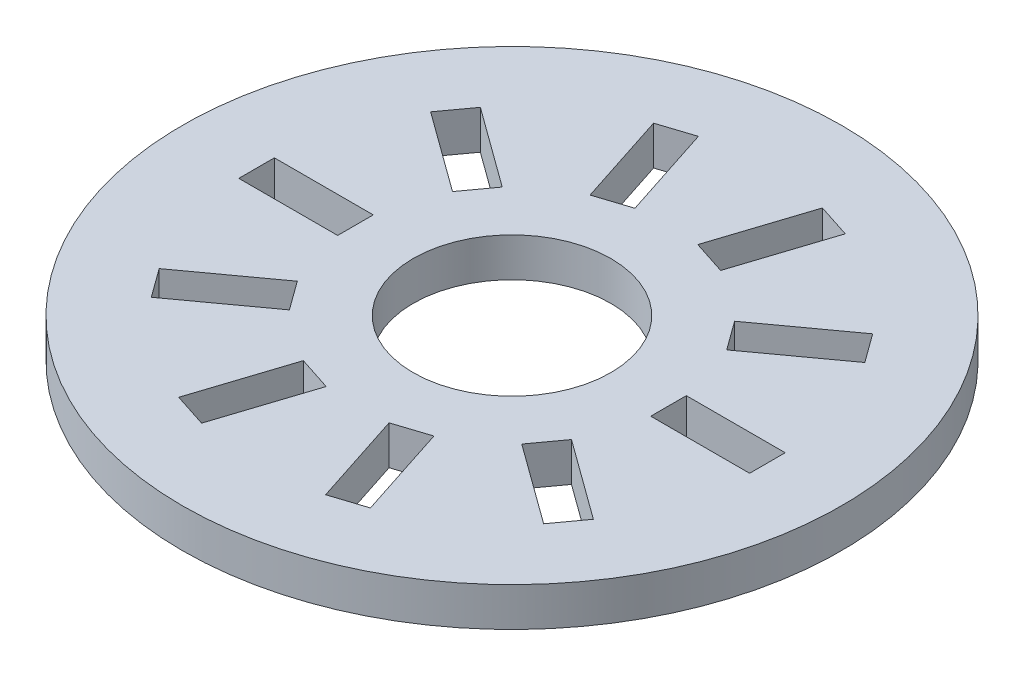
ISO-10303-21;
HEADER;
FILE_DESCRIPTION(('STEP AP214'),'2;1');
FILE_NAME('part.step','',(''),(''),'','','');
FILE_SCHEMA(('AUTOMOTIVE_DESIGN { 1 0 10303 214 1 1 1 1 }'));
ENDSEC;
DATA;
#1=APPLICATION_CONTEXT('core data for automotive mechanical design processes');
#2=APPLICATION_PROTOCOL_DEFINITION('international standard','automotive_design',2000,#1);
#3=PRODUCT_CONTEXT('',#1,'mechanical');
#4=PRODUCT('Part','Part','',(#3));
#5=PRODUCT_RELATED_PRODUCT_CATEGORY('part','',(#4));
#6=PRODUCT_DEFINITION_FORMATION('','',#4);
#7=PRODUCT_DEFINITION_CONTEXT('part definition',#1,'design');
#8=PRODUCT_DEFINITION('design','',#6,#7);
#9=PRODUCT_DEFINITION_SHAPE('','',#8);
#10=(LENGTH_UNIT() NAMED_UNIT(*) SI_UNIT(.MILLI.,.METRE.));
#11=(NAMED_UNIT(*) PLANE_ANGLE_UNIT() SI_UNIT($,.RADIAN.));
#12=(NAMED_UNIT(*) SI_UNIT($,.STERADIAN.) SOLID_ANGLE_UNIT());
#13=UNCERTAINTY_MEASURE_WITH_UNIT(LENGTH_MEASURE(1.E-05),#10,'distance_accuracy_value','');
#14=(GEOMETRIC_REPRESENTATION_CONTEXT(3) GLOBAL_UNCERTAINTY_ASSIGNED_CONTEXT((#13)) GLOBAL_UNIT_ASSIGNED_CONTEXT((#10,
#11,#12)) REPRESENTATION_CONTEXT('',''));
#15=CARTESIAN_POINT('',(0.,0.,0.));
#16=DIRECTION('',(0.,0.,1.));
#17=DIRECTION('',(1.,0.,0.));
#18=AXIS2_PLACEMENT_3D('',#15,#16,#17);
#19=CARTESIAN_POINT('',(0.,2.9972,0.));
#20=DIRECTION('',(0.,1.,0.));
#21=DIRECTION('',(0.,0.,1.));
#22=AXIS2_PLACEMENT_3D('',#19,#20,#21);
#23=PLANE('',#22);
#24=DIRECTION('',(-0.809016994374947,0.,0.587785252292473));
#25=VECTOR('',#24,1.);
#26=CARTESIAN_POINT('',(8.95458378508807,2.9972,-8.20127677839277));
#27=LINE('',#26,#25);
#28=CARTESIAN_POINT('',(15.1192932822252,2.9972,-12.6802004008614));
#29=VERTEX_POINT('',#28);
#30=CARTESIAN_POINT('',(8.95458378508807,2.9972,-8.20127677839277));
#31=VERTEX_POINT('',#30);
#32=EDGE_CURVE('E298',#29,#31,#27,.T.);
#33=ORIENTED_EDGE('',*,*,#32,.F.);
#34=DIRECTION('',(-0.587785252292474,0.,-0.809016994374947));
#35=VECTOR('',#34,1.);
#36=CARTESIAN_POINT('',(16.7317057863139,2.9972,-10.4609049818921));
#37=LINE('',#36,#35);
#38=CARTESIAN_POINT('',(16.7317057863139,2.9972,-10.4609049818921));
#39=VERTEX_POINT('',#38);
#40=EDGE_CURVE('E290',#39,#29,#37,.T.);
#41=ORIENTED_EDGE('',*,*,#40,.F.);
#42=DIRECTION('',(0.809016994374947,0.,-0.587785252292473));
#43=VECTOR('',#42,1.);
#44=CARTESIAN_POINT('',(10.5669962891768,2.9972,-5.98198135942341));
#45=LINE('',#44,#43);
#46=CARTESIAN_POINT('',(10.5669962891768,2.9972,-5.98198135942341));
#47=VERTEX_POINT('',#46);
#48=EDGE_CURVE('E313',#47,#39,#45,.T.);
#49=ORIENTED_EDGE('',*,*,#48,.F.);
#50=DIRECTION('',(0.587785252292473,0.,0.809016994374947));
#51=VECTOR('',#50,1.);
#52=CARTESIAN_POINT('',(10.5669962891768,2.9972,-5.98198135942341));
#53=LINE('',#52,#51);
#54=EDGE_CURVE('E311',#31,#47,#53,.T.);
#55=ORIENTED_EDGE('',*,*,#54,.F.);
#56=EDGE_LOOP('',(#33,#41,#49,#55));
#57=FACE_BOUND('',#56,.T.);
#58=DIRECTION('',(0.309016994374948,0.,0.951056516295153));
#59=VECTOR('',#58,1.);
#60=CARTESIAN_POINT('',(-5.03275915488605,2.9972,-11.0506491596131));
#61=LINE('',#60,#59);
#62=CARTESIAN_POINT('',(-7.38746865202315,2.9972,-18.2976998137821));
#63=VERTEX_POINT('',#62);
#64=CARTESIAN_POINT('',(-5.03275915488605,2.9972,-11.0506491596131));
#65=VERTEX_POINT('',#64);
#66=EDGE_CURVE('E362',#63,#65,#61,.T.);
#67=ORIENTED_EDGE('',*,*,#66,.F.);
#68=DIRECTION('',(-0.951056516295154,0.,0.309016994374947));
#69=VECTOR('',#68,1.);
#70=CARTESIAN_POINT('',(-4.77853041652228,2.9972,-19.1453952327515));
#71=LINE('',#70,#69);
#72=CARTESIAN_POINT('',(-4.77853041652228,2.9972,-19.1453952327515));
#73=VERTEX_POINT('',#72);
#74=EDGE_CURVE('E360',#73,#63,#71,.T.);
#75=ORIENTED_EDGE('',*,*,#74,.F.);
#76=DIRECTION('',(-0.309016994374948,0.,-0.951056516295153));
#77=VECTOR('',#76,1.);
#78=CARTESIAN_POINT('',(-2.42382091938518,2.9972,-11.8983445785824));
#79=LINE('',#78,#77);
#80=CARTESIAN_POINT('',(-2.42382091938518,2.9972,-11.8983445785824));
#81=VERTEX_POINT('',#80);
#82=EDGE_CURVE('E368',#81,#73,#79,.T.);
#83=ORIENTED_EDGE('',*,*,#82,.F.);
#84=DIRECTION('',(0.951056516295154,0.,-0.309016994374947));
#85=VECTOR('',#84,1.);
#86=CARTESIAN_POINT('',(-2.42382091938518,2.9972,-11.8983445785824));
#87=LINE('',#86,#85);
#88=EDGE_CURVE('E365',#65,#81,#87,.T.);
#89=ORIENTED_EDGE('',*,*,#88,.F.);
#90=EDGE_LOOP('',(#67,#75,#83,#89));
#91=FACE_BOUND('',#90,.T.);
#92=DIRECTION('',(1.,0.,0.));
#93=VECTOR('',#92,1.);
#94=CARTESIAN_POINT('',(-12.0649999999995,2.9972,1.37160000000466));
#95=LINE('',#94,#93);
#96=CARTESIAN_POINT('',(-19.6849999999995,2.9972,1.37160000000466));
#97=VERTEX_POINT('',#96);
#98=CARTESIAN_POINT('',(-12.0649999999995,2.9972,1.37160000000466));
#99=VERTEX_POINT('',#98);
#100=EDGE_CURVE('E424',#97,#99,#95,.T.);
#101=ORIENTED_EDGE('',*,*,#100,.F.);
#102=DIRECTION('',(0.,0.,1.));
#103=VECTOR('',#102,1.);
#104=CARTESIAN_POINT('',(-19.6849999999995,2.9972,-1.37159999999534));
#105=LINE('',#104,#103);
#106=CARTESIAN_POINT('',(-19.6849999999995,2.9972,-1.37159999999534));
#107=VERTEX_POINT('',#106);
#108=EDGE_CURVE('E422',#107,#97,#105,.T.);
#109=ORIENTED_EDGE('',*,*,#108,.F.);
#110=DIRECTION('',(-1.,0.,0.));
#111=VECTOR('',#110,1.);
#112=CARTESIAN_POINT('',(-12.0649999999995,2.9972,-1.37159999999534));
#113=LINE('',#112,#111);
#114=CARTESIAN_POINT('',(-12.0649999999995,2.9972,-1.37159999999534));
#115=VERTEX_POINT('',#114);
#116=EDGE_CURVE('E430',#115,#107,#113,.T.);
#117=ORIENTED_EDGE('',*,*,#116,.F.);
#118=DIRECTION('',(0.,0.,-1.));
#119=VECTOR('',#118,1.);
#120=CARTESIAN_POINT('',(-12.0649999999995,2.9972,-1.37159999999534));
#121=LINE('',#120,#119);
#122=EDGE_CURVE('E427',#99,#115,#121,.T.);
#123=ORIENTED_EDGE('',*,*,#122,.F.);
#124=EDGE_LOOP('',(#101,#109,#117,#123));
#125=FACE_BOUND('',#124,.T.);
#126=DIRECTION('',(0.309016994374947,0.,-0.951056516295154));
#127=VECTOR('',#126,1.);
#128=CARTESIAN_POINT('',(-2.42382091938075,2.9972,11.8983445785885));
#129=LINE('',#128,#127);
#130=CARTESIAN_POINT('',(-4.77853041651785,2.9972,19.1453952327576));
#131=VERTEX_POINT('',#130);
#132=CARTESIAN_POINT('',(-2.42382091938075,2.9972,11.8983445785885));
#133=VERTEX_POINT('',#132);
#134=EDGE_CURVE('E486',#131,#133,#129,.T.);
#135=ORIENTED_EDGE('',*,*,#134,.F.);
#136=DIRECTION('',(0.951056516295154,0.,0.309016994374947));
#137=VECTOR('',#136,1.);
#138=CARTESIAN_POINT('',(-7.38746865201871,2.9972,18.2976998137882));
#139=LINE('',#138,#137);
#140=CARTESIAN_POINT('',(-7.38746865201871,2.9972,18.2976998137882));
#141=VERTEX_POINT('',#140);
#142=EDGE_CURVE('E484',#141,#131,#139,.T.);
#143=ORIENTED_EDGE('',*,*,#142,.F.);
#144=DIRECTION('',(-0.309016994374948,0.,0.951056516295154));
#145=VECTOR('',#144,1.);
#146=CARTESIAN_POINT('',(-5.03275915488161,2.9972,11.0506491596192));
#147=LINE('',#146,#145);
#148=CARTESIAN_POINT('',(-5.03275915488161,2.9972,11.0506491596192));
#149=VERTEX_POINT('',#148);
#150=EDGE_CURVE('E492',#149,#141,#147,.T.);
#151=ORIENTED_EDGE('',*,*,#150,.F.);
#152=DIRECTION('',(-0.951056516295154,0.,-0.309016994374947));
#153=VECTOR('',#152,1.);
#154=CARTESIAN_POINT('',(-5.03275915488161,2.9972,11.0506491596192));
#155=LINE('',#154,#153);
#156=EDGE_CURVE('E489',#133,#149,#155,.T.);
#157=ORIENTED_EDGE('',*,*,#156,.F.);
#158=EDGE_LOOP('',(#135,#143,#151,#157));
#159=FACE_BOUND('',#158,.T.);
#160=DIRECTION('',(-0.809016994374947,0.,-0.587785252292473));
#161=VECTOR('',#160,1.);
#162=CARTESIAN_POINT('',(10.5669962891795,2.9972,5.9819813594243));
#163=LINE('',#162,#161);
#164=CARTESIAN_POINT('',(16.7317057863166,2.9972,10.4609049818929));
#165=VERTEX_POINT('',#164);
#166=CARTESIAN_POINT('',(10.5669962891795,2.9972,5.9819813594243));
#167=VERTEX_POINT('',#166);
#168=EDGE_CURVE('E548',#165,#167,#163,.T.);
#169=ORIENTED_EDGE('',*,*,#168,.F.);
#170=DIRECTION('',(0.587785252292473,0.,-0.809016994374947));
#171=VECTOR('',#170,1.);
#172=CARTESIAN_POINT('',(15.1192932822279,2.9972,12.6802004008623));
#173=LINE('',#172,#171);
#174=CARTESIAN_POINT('',(15.1192932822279,2.9972,12.6802004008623));
#175=VERTEX_POINT('',#174);
#176=EDGE_CURVE('E546',#175,#165,#173,.T.);
#177=ORIENTED_EDGE('',*,*,#176,.F.);
#178=DIRECTION('',(0.809016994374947,0.,0.587785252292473));
#179=VECTOR('',#178,1.);
#180=CARTESIAN_POINT('',(8.95458378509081,2.9972,8.20127677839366));
#181=LINE('',#180,#179);
#182=CARTESIAN_POINT('',(8.95458378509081,2.9972,8.20127677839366));
#183=VERTEX_POINT('',#182);
#184=EDGE_CURVE('E554',#183,#175,#181,.T.);
#185=ORIENTED_EDGE('',*,*,#184,.F.);
#186=DIRECTION('',(-0.587785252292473,0.,0.809016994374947));
#187=VECTOR('',#186,1.);
#188=CARTESIAN_POINT('',(8.95458378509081,2.9972,8.20127677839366));
#189=LINE('',#188,#187);
#190=EDGE_CURVE('E551',#167,#183,#189,.T.);
#191=ORIENTED_EDGE('',*,*,#190,.F.);
#192=EDGE_LOOP('',(#169,#177,#185,#191));
#193=FACE_BOUND('',#192,.T.);
#194=CARTESIAN_POINT('',(0.,2.9972,0.));
#195=DIRECTION('',(0.,1.,0.));
#196=DIRECTION('',(0.,0.,1.));
#197=AXIS2_PLACEMENT_3D('',#194,#195,#196);
#198=CIRCLE('',#197,25.4);
#199=CARTESIAN_POINT('',(0.,2.9972,-25.4));
#200=VERTEX_POINT('',#199);
#201=EDGE_CURVE('E11',#200,#200,#198,.T.);
#202=ORIENTED_EDGE('',*,*,#201,.T.);
#203=EDGE_LOOP('',(#202));
#204=FACE_BOUND('',#203,.T.);
#205=DIRECTION('',(-1.,0.,0.));
#206=VECTOR('',#205,1.);
#207=CARTESIAN_POINT('',(12.065,2.9972,-1.3716));
#208=LINE('',#207,#206);
#209=CARTESIAN_POINT('',(19.685,2.9972,-1.3716));
#210=VERTEX_POINT('',#209);
#211=CARTESIAN_POINT('',(12.065,2.9972,-1.3716));
#212=VERTEX_POINT('',#211);
#213=EDGE_CURVE('E579',#210,#212,#208,.T.);
#214=ORIENTED_EDGE('',*,*,#213,.F.);
#215=DIRECTION('',(0.,0.,-1.));
#216=VECTOR('',#215,1.);
#217=CARTESIAN_POINT('',(19.685,2.9972,1.3716));
#218=LINE('',#217,#216);
#219=CARTESIAN_POINT('',(19.685,2.9972,1.3716));
#220=VERTEX_POINT('',#219);
#221=EDGE_CURVE('E577',#220,#210,#218,.T.);
#222=ORIENTED_EDGE('',*,*,#221,.F.);
#223=DIRECTION('',(1.,0.,0.));
#224=VECTOR('',#223,1.);
#225=CARTESIAN_POINT('',(12.065,2.9972,1.3716));
#226=LINE('',#225,#224);
#227=CARTESIAN_POINT('',(12.065,2.9972,1.3716));
#228=VERTEX_POINT('',#227);
#229=EDGE_CURVE('E585',#228,#220,#226,.T.);
#230=ORIENTED_EDGE('',*,*,#229,.F.);
#231=DIRECTION('',(0.,0.,1.));
#232=VECTOR('',#231,1.);
#233=CARTESIAN_POINT('',(12.065,2.9972,1.3716));
#234=LINE('',#233,#232);
#235=EDGE_CURVE('E582',#212,#228,#234,.T.);
#236=ORIENTED_EDGE('',*,*,#235,.F.);
#237=EDGE_LOOP('',(#214,#222,#230,#236));
#238=FACE_BOUND('',#237,.T.);
#239=DIRECTION('',(-0.309016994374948,0.,-0.951056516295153));
#240=VECTOR('',#239,1.);
#241=CARTESIAN_POINT('',(5.03275915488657,2.9972,11.0506491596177));
#242=LINE('',#241,#240);
#243=CARTESIAN_POINT('',(7.38746865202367,2.9972,18.2976998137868));
#244=VERTEX_POINT('',#243);
#245=CARTESIAN_POINT('',(5.03275915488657,2.9972,11.0506491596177));
#246=VERTEX_POINT('',#245);
#247=EDGE_CURVE('E517',#244,#246,#242,.T.);
#248=ORIENTED_EDGE('',*,*,#247,.F.);
#249=DIRECTION('',(0.951056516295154,0.,-0.309016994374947));
#250=VECTOR('',#249,1.);
#251=CARTESIAN_POINT('',(4.77853041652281,2.9972,19.1453952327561));
#252=LINE('',#251,#250);
#253=CARTESIAN_POINT('',(4.77853041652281,2.9972,19.1453952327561));
#254=VERTEX_POINT('',#253);
#255=EDGE_CURVE('E515',#254,#244,#252,.T.);
#256=ORIENTED_EDGE('',*,*,#255,.F.);
#257=DIRECTION('',(0.309016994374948,0.,0.951056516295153));
#258=VECTOR('',#257,1.);
#259=CARTESIAN_POINT('',(2.42382091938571,2.9972,11.8983445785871));
#260=LINE('',#259,#258);
#261=CARTESIAN_POINT('',(2.42382091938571,2.9972,11.8983445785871));
#262=VERTEX_POINT('',#261);
#263=EDGE_CURVE('E523',#262,#254,#260,.T.);
#264=ORIENTED_EDGE('',*,*,#263,.F.);
#265=DIRECTION('',(-0.951056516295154,0.,0.309016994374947));
#266=VECTOR('',#265,1.);
#267=CARTESIAN_POINT('',(2.42382091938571,2.9972,11.8983445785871));
#268=LINE('',#267,#266);
#269=EDGE_CURVE('E520',#246,#262,#268,.T.);
#270=ORIENTED_EDGE('',*,*,#269,.F.);
#271=EDGE_LOOP('',(#248,#256,#264,#270));
#272=FACE_BOUND('',#271,.T.);
#273=DIRECTION('',(0.809016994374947,0.,-0.587785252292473));
#274=VECTOR('',#273,1.);
#275=CARTESIAN_POINT('',(-8.95458378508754,2.9972,8.20127677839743));
#276=LINE('',#275,#274);
#277=CARTESIAN_POINT('',(-15.1192932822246,2.9972,12.6802004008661));
#278=VERTEX_POINT('',#277);
#279=CARTESIAN_POINT('',(-8.95458378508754,2.9972,8.20127677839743));
#280=VERTEX_POINT('',#279);
#281=EDGE_CURVE('E455',#278,#280,#276,.T.);
#282=ORIENTED_EDGE('',*,*,#281,.F.);
#283=DIRECTION('',(0.587785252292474,0.,0.809016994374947));
#284=VECTOR('',#283,1.);
#285=CARTESIAN_POINT('',(-16.7317057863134,2.9972,10.4609049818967));
#286=LINE('',#285,#284);
#287=CARTESIAN_POINT('',(-16.7317057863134,2.9972,10.4609049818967));
#288=VERTEX_POINT('',#287);
#289=EDGE_CURVE('E453',#288,#278,#286,.T.);
#290=ORIENTED_EDGE('',*,*,#289,.F.);
#291=DIRECTION('',(-0.809016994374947,0.,0.587785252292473));
#292=VECTOR('',#291,1.);
#293=CARTESIAN_POINT('',(-10.5669962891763,2.9972,5.98198135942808));
#294=LINE('',#293,#292);
#295=CARTESIAN_POINT('',(-10.5669962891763,2.9972,5.98198135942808));
#296=VERTEX_POINT('',#295);
#297=EDGE_CURVE('E461',#296,#288,#294,.T.);
#298=ORIENTED_EDGE('',*,*,#297,.F.);
#299=DIRECTION('',(-0.587785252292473,0.,-0.809016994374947));
#300=VECTOR('',#299,1.);
#301=CARTESIAN_POINT('',(-10.5669962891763,2.9972,5.98198135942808));
#302=LINE('',#301,#300);
#303=EDGE_CURVE('E458',#280,#296,#302,.T.);
#304=ORIENTED_EDGE('',*,*,#303,.F.);
#305=EDGE_LOOP('',(#282,#290,#298,#304));
#306=FACE_BOUND('',#305,.T.);
#307=DIRECTION('',(0.809016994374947,0.,0.587785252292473));
#308=VECTOR('',#307,1.);
#309=CARTESIAN_POINT('',(-10.566996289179,2.9972,-5.98198135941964));
#310=LINE('',#309,#308);
#311=CARTESIAN_POINT('',(-16.7317057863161,2.9972,-10.4609049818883));
#312=VERTEX_POINT('',#311);
#313=CARTESIAN_POINT('',(-10.566996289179,2.9972,-5.98198135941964));
#314=VERTEX_POINT('',#313);
#315=EDGE_CURVE('E393',#312,#314,#310,.T.);
#316=ORIENTED_EDGE('',*,*,#315,.F.);
#317=DIRECTION('',(-0.587785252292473,0.,0.809016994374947));
#318=VECTOR('',#317,1.);
#319=CARTESIAN_POINT('',(-15.1192932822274,2.9972,-12.6802004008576));
#320=LINE('',#319,#318);
#321=CARTESIAN_POINT('',(-15.1192932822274,2.9972,-12.6802004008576));
#322=VERTEX_POINT('',#321);
#323=EDGE_CURVE('E391',#322,#312,#320,.T.);
#324=ORIENTED_EDGE('',*,*,#323,.F.);
#325=DIRECTION('',(-0.809016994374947,0.,-0.587785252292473));
#326=VECTOR('',#325,1.);
#327=CARTESIAN_POINT('',(-8.95458378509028,2.9972,-8.201276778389));
#328=LINE('',#327,#326);
#329=CARTESIAN_POINT('',(-8.95458378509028,2.9972,-8.201276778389));
#330=VERTEX_POINT('',#329);
#331=EDGE_CURVE('E399',#330,#322,#328,.T.);
#332=ORIENTED_EDGE('',*,*,#331,.F.);
#333=DIRECTION('',(0.587785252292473,0.,-0.809016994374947));
#334=VECTOR('',#333,1.);
#335=CARTESIAN_POINT('',(-8.95458378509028,2.9972,-8.201276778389));
#336=LINE('',#335,#334);
#337=EDGE_CURVE('E396',#314,#330,#336,.T.);
#338=ORIENTED_EDGE('',*,*,#337,.F.);
#339=EDGE_LOOP('',(#316,#324,#332,#338));
#340=FACE_BOUND('',#339,.T.);
#341=DIRECTION('',(-0.309016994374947,0.,0.951056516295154));
#342=VECTOR('',#341,1.);
#343=CARTESIAN_POINT('',(2.42382091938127,2.9972,-11.8983445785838));
#344=LINE('',#343,#342);
#345=CARTESIAN_POINT('',(4.77853041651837,2.9972,-19.1453952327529));
#346=VERTEX_POINT('',#345);
#347=CARTESIAN_POINT('',(2.42382091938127,2.9972,-11.8983445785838));
#348=VERTEX_POINT('',#347);
#349=EDGE_CURVE('E331',#346,#348,#344,.T.);
#350=ORIENTED_EDGE('',*,*,#349,.F.);
#351=DIRECTION('',(-0.951056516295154,0.,-0.309016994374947));
#352=VECTOR('',#351,1.);
#353=CARTESIAN_POINT('',(7.38746865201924,2.9972,-18.2976998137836));
#354=LINE('',#353,#352);
#355=CARTESIAN_POINT('',(7.38746865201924,2.9972,-18.2976998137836));
#356=VERTEX_POINT('',#355);
#357=EDGE_CURVE('E329',#356,#346,#354,.T.);
#358=ORIENTED_EDGE('',*,*,#357,.F.);
#359=DIRECTION('',(0.309016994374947,0.,-0.951056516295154));
#360=VECTOR('',#359,1.);
#361=CARTESIAN_POINT('',(5.03275915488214,2.9972,-11.0506491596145));
#362=LINE('',#361,#360);
#363=CARTESIAN_POINT('',(5.03275915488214,2.9972,-11.0506491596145));
#364=VERTEX_POINT('',#363);
#365=EDGE_CURVE('E337',#364,#356,#362,.T.);
#366=ORIENTED_EDGE('',*,*,#365,.F.);
#367=DIRECTION('',(0.951056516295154,0.,0.309016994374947));
#368=VECTOR('',#367,1.);
#369=CARTESIAN_POINT('',(5.03275915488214,2.9972,-11.0506491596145));
#370=LINE('',#369,#368);
#371=EDGE_CURVE('E334',#348,#364,#370,.T.);
#372=ORIENTED_EDGE('',*,*,#371,.F.);
#373=EDGE_LOOP('',(#350,#358,#366,#372));
#374=FACE_BOUND('',#373,.T.);
#375=CARTESIAN_POINT('',(0.,2.9972,0.));
#376=DIRECTION('',(0.,1.,0.));
#377=DIRECTION('',(0.,0.,1.));
#378=AXIS2_PLACEMENT_3D('',#375,#376,#377);
#379=CIRCLE('',#378,7.62);
#380=CARTESIAN_POINT('',(0.,2.9972,-7.62));
#381=VERTEX_POINT('',#380);
#382=EDGE_CURVE('E319',#381,#381,#379,.T.);
#383=ORIENTED_EDGE('',*,*,#382,.F.);
#384=EDGE_LOOP('',(#383));
#385=FACE_BOUND('',#384,.T.);
#386=ADVANCED_FACE('F33',(#57,#91,#125,#159,#193,#204,#238,#272,#306,#340,#374,#385),#23,.T.);
#387=CARTESIAN_POINT('',(0.,0.,0.));
#388=DIRECTION('',(0.,1.,0.));
#389=DIRECTION('',(0.,0.,1.));
#390=AXIS2_PLACEMENT_3D('',#387,#388,#389);
#391=PLANE('',#390);
#392=DIRECTION('',(-0.587785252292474,0.,-0.809016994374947));
#393=VECTOR('',#392,1.);
#394=CARTESIAN_POINT('',(16.7317057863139,0.,-10.4609049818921));
#395=LINE('',#394,#393);
#396=CARTESIAN_POINT('',(16.7317057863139,0.,-10.4609049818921));
#397=VERTEX_POINT('',#396);
#398=CARTESIAN_POINT('',(15.1192932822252,0.,-12.6802004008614));
#399=VERTEX_POINT('',#398);
#400=EDGE_CURVE('E56',#397,#399,#395,.T.);
#401=ORIENTED_EDGE('',*,*,#400,.T.);
#402=DIRECTION('',(-0.809016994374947,0.,0.587785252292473));
#403=VECTOR('',#402,1.);
#404=CARTESIAN_POINT('',(8.95458378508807,0.,-8.20127677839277));
#405=LINE('',#404,#403);
#406=CARTESIAN_POINT('',(8.95458378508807,0.,-8.20127677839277));
#407=VERTEX_POINT('',#406);
#408=EDGE_CURVE('E305',#399,#407,#405,.T.);
#409=ORIENTED_EDGE('',*,*,#408,.T.);
#410=DIRECTION('',(0.587785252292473,0.,0.809016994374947));
#411=VECTOR('',#410,1.);
#412=CARTESIAN_POINT('',(10.5669962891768,0.,-5.98198135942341));
#413=LINE('',#412,#411);
#414=CARTESIAN_POINT('',(10.5669962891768,0.,-5.98198135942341));
#415=VERTEX_POINT('',#414);
#416=EDGE_CURVE('E321',#407,#415,#413,.T.);
#417=ORIENTED_EDGE('',*,*,#416,.T.);
#418=DIRECTION('',(0.809016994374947,0.,-0.587785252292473));
#419=VECTOR('',#418,1.);
#420=CARTESIAN_POINT('',(10.5669962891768,0.,-5.98198135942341));
#421=LINE('',#420,#419);
#422=EDGE_CURVE('E299',#415,#397,#421,.T.);
#423=ORIENTED_EDGE('',*,*,#422,.T.);
#424=EDGE_LOOP('',(#401,#409,#417,#423));
#425=FACE_BOUND('',#424,.T.);
#426=DIRECTION('',(-0.951056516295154,0.,0.309016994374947));
#427=VECTOR('',#426,1.);
#428=CARTESIAN_POINT('',(-4.77853041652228,0.,-19.1453952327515));
#429=LINE('',#428,#427);
#430=CARTESIAN_POINT('',(-4.77853041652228,0.,-19.1453952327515));
#431=VERTEX_POINT('',#430);
#432=CARTESIAN_POINT('',(-7.38746865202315,0.,-18.2976998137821));
#433=VERTEX_POINT('',#432);
#434=EDGE_CURVE('E359',#431,#433,#429,.T.);
#435=ORIENTED_EDGE('',*,*,#434,.T.);
#436=DIRECTION('',(0.309016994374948,0.,0.951056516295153));
#437=VECTOR('',#436,1.);
#438=CARTESIAN_POINT('',(-5.03275915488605,0.,-11.0506491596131));
#439=LINE('',#438,#437);
#440=CARTESIAN_POINT('',(-5.03275915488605,0.,-11.0506491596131));
#441=VERTEX_POINT('',#440);
#442=EDGE_CURVE('E373',#433,#441,#439,.T.);
#443=ORIENTED_EDGE('',*,*,#442,.T.);
#444=DIRECTION('',(0.951056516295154,0.,-0.309016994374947));
#445=VECTOR('',#444,1.);
#446=CARTESIAN_POINT('',(-2.42382091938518,0.,-11.8983445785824));
#447=LINE('',#446,#445);
#448=CARTESIAN_POINT('',(-2.42382091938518,0.,-11.8983445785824));
#449=VERTEX_POINT('',#448);
#450=EDGE_CURVE('E376',#441,#449,#447,.T.);
#451=ORIENTED_EDGE('',*,*,#450,.T.);
#452=DIRECTION('',(-0.309016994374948,0.,-0.951056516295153));
#453=VECTOR('',#452,1.);
#454=CARTESIAN_POINT('',(-2.42382091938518,0.,-11.8983445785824));
#455=LINE('',#454,#453);
#456=EDGE_CURVE('E363',#449,#431,#455,.T.);
#457=ORIENTED_EDGE('',*,*,#456,.T.);
#458=EDGE_LOOP('',(#435,#443,#451,#457));
#459=FACE_BOUND('',#458,.T.);
#460=DIRECTION('',(0.,0.,1.));
#461=VECTOR('',#460,1.);
#462=CARTESIAN_POINT('',(-19.6849999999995,0.,-1.37159999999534));
#463=LINE('',#462,#461);
#464=CARTESIAN_POINT('',(-19.6849999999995,0.,-1.37159999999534));
#465=VERTEX_POINT('',#464);
#466=CARTESIAN_POINT('',(-19.6849999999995,0.,1.37160000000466));
#467=VERTEX_POINT('',#466);
#468=EDGE_CURVE('E421',#465,#467,#463,.T.);
#469=ORIENTED_EDGE('',*,*,#468,.T.);
#470=DIRECTION('',(1.,0.,0.));
#471=VECTOR('',#470,1.);
#472=CARTESIAN_POINT('',(-12.0649999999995,0.,1.37160000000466));
#473=LINE('',#472,#471);
#474=CARTESIAN_POINT('',(-12.0649999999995,0.,1.37160000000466));
#475=VERTEX_POINT('',#474);
#476=EDGE_CURVE('E435',#467,#475,#473,.T.);
#477=ORIENTED_EDGE('',*,*,#476,.T.);
#478=DIRECTION('',(0.,0.,-1.));
#479=VECTOR('',#478,1.);
#480=CARTESIAN_POINT('',(-12.0649999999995,0.,-1.37159999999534));
#481=LINE('',#480,#479);
#482=CARTESIAN_POINT('',(-12.0649999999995,0.,-1.37159999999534));
#483=VERTEX_POINT('',#482);
#484=EDGE_CURVE('E438',#475,#483,#481,.T.);
#485=ORIENTED_EDGE('',*,*,#484,.T.);
#486=DIRECTION('',(-1.,0.,0.));
#487=VECTOR('',#486,1.);
#488=CARTESIAN_POINT('',(-12.0649999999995,0.,-1.37159999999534));
#489=LINE('',#488,#487);
#490=EDGE_CURVE('E425',#483,#465,#489,.T.);
#491=ORIENTED_EDGE('',*,*,#490,.T.);
#492=EDGE_LOOP('',(#469,#477,#485,#491));
#493=FACE_BOUND('',#492,.T.);
#494=DIRECTION('',(0.951056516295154,0.,0.309016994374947));
#495=VECTOR('',#494,1.);
#496=CARTESIAN_POINT('',(-7.38746865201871,0.,18.2976998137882));
#497=LINE('',#496,#495);
#498=CARTESIAN_POINT('',(-7.38746865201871,0.,18.2976998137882));
#499=VERTEX_POINT('',#498);
#500=CARTESIAN_POINT('',(-4.77853041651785,0.,19.1453952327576));
#501=VERTEX_POINT('',#500);
#502=EDGE_CURVE('E483',#499,#501,#497,.T.);
#503=ORIENTED_EDGE('',*,*,#502,.T.);
#504=DIRECTION('',(0.309016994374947,0.,-0.951056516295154));
#505=VECTOR('',#504,1.);
#506=CARTESIAN_POINT('',(-2.42382091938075,0.,11.8983445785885));
#507=LINE('',#506,#505);
#508=CARTESIAN_POINT('',(-2.42382091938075,0.,11.8983445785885));
#509=VERTEX_POINT('',#508);
#510=EDGE_CURVE('E497',#501,#509,#507,.T.);
#511=ORIENTED_EDGE('',*,*,#510,.T.);
#512=DIRECTION('',(-0.951056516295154,0.,-0.309016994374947));
#513=VECTOR('',#512,1.);
#514=CARTESIAN_POINT('',(-5.03275915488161,0.,11.0506491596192));
#515=LINE('',#514,#513);
#516=CARTESIAN_POINT('',(-5.03275915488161,0.,11.0506491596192));
#517=VERTEX_POINT('',#516);
#518=EDGE_CURVE('E500',#509,#517,#515,.T.);
#519=ORIENTED_EDGE('',*,*,#518,.T.);
#520=DIRECTION('',(-0.309016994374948,0.,0.951056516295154));
#521=VECTOR('',#520,1.);
#522=CARTESIAN_POINT('',(-5.03275915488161,0.,11.0506491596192));
#523=LINE('',#522,#521);
#524=EDGE_CURVE('E487',#517,#499,#523,.T.);
#525=ORIENTED_EDGE('',*,*,#524,.T.);
#526=EDGE_LOOP('',(#503,#511,#519,#525));
#527=FACE_BOUND('',#526,.T.);
#528=DIRECTION('',(0.587785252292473,0.,-0.809016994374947));
#529=VECTOR('',#528,1.);
#530=CARTESIAN_POINT('',(15.1192932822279,0.,12.6802004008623));
#531=LINE('',#530,#529);
#532=CARTESIAN_POINT('',(15.1192932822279,0.,12.6802004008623));
#533=VERTEX_POINT('',#532);
#534=CARTESIAN_POINT('',(16.7317057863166,0.,10.4609049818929));
#535=VERTEX_POINT('',#534);
#536=EDGE_CURVE('E545',#533,#535,#531,.T.);
#537=ORIENTED_EDGE('',*,*,#536,.T.);
#538=DIRECTION('',(-0.809016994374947,0.,-0.587785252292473));
#539=VECTOR('',#538,1.);
#540=CARTESIAN_POINT('',(10.5669962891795,0.,5.9819813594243));
#541=LINE('',#540,#539);
#542=CARTESIAN_POINT('',(10.5669962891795,0.,5.9819813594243));
#543=VERTEX_POINT('',#542);
#544=EDGE_CURVE('E559',#535,#543,#541,.T.);
#545=ORIENTED_EDGE('',*,*,#544,.T.);
#546=DIRECTION('',(-0.587785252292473,0.,0.809016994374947));
#547=VECTOR('',#546,1.);
#548=CARTESIAN_POINT('',(8.95458378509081,0.,8.20127677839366));
#549=LINE('',#548,#547);
#550=CARTESIAN_POINT('',(8.95458378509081,0.,8.20127677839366));
#551=VERTEX_POINT('',#550);
#552=EDGE_CURVE('E562',#543,#551,#549,.T.);
#553=ORIENTED_EDGE('',*,*,#552,.T.);
#554=DIRECTION('',(0.809016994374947,0.,0.587785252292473));
#555=VECTOR('',#554,1.);
#556=CARTESIAN_POINT('',(8.95458378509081,0.,8.20127677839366));
#557=LINE('',#556,#555);
#558=EDGE_CURVE('E549',#551,#533,#557,.T.);
#559=ORIENTED_EDGE('',*,*,#558,.T.);
#560=EDGE_LOOP('',(#537,#545,#553,#559));
#561=FACE_BOUND('',#560,.T.);
#562=CARTESIAN_POINT('',(0.,0.,0.));
#563=DIRECTION('',(0.,1.,0.));
#564=DIRECTION('',(0.,0.,1.));
#565=AXIS2_PLACEMENT_3D('',#562,#563,#564);
#566=CIRCLE('',#565,25.4);
#567=CARTESIAN_POINT('',(0.,0.,-25.4));
#568=VERTEX_POINT('',#567);
#569=EDGE_CURVE('E37',#568,#568,#566,.T.);
#570=ORIENTED_EDGE('',*,*,#569,.F.);
#571=EDGE_LOOP('',(#570));
#572=FACE_BOUND('',#571,.T.);
#573=DIRECTION('',(0.,0.,-1.));
#574=VECTOR('',#573,1.);
#575=CARTESIAN_POINT('',(19.685,0.,1.3716));
#576=LINE('',#575,#574);
#577=CARTESIAN_POINT('',(19.685,0.,1.3716));
#578=VERTEX_POINT('',#577);
#579=CARTESIAN_POINT('',(19.685,0.,-1.3716));
#580=VERTEX_POINT('',#579);
#581=EDGE_CURVE('E576',#578,#580,#576,.T.);
#582=ORIENTED_EDGE('',*,*,#581,.T.);
#583=DIRECTION('',(-1.,0.,0.));
#584=VECTOR('',#583,1.);
#585=CARTESIAN_POINT('',(12.065,0.,-1.3716));
#586=LINE('',#585,#584);
#587=CARTESIAN_POINT('',(12.065,0.,-1.3716));
#588=VERTEX_POINT('',#587);
#589=EDGE_CURVE('E590',#580,#588,#586,.T.);
#590=ORIENTED_EDGE('',*,*,#589,.T.);
#591=DIRECTION('',(0.,0.,1.));
#592=VECTOR('',#591,1.);
#593=CARTESIAN_POINT('',(12.065,0.,1.3716));
#594=LINE('',#593,#592);
#595=CARTESIAN_POINT('',(12.065,0.,1.3716));
#596=VERTEX_POINT('',#595);
#597=EDGE_CURVE('E593',#588,#596,#594,.T.);
#598=ORIENTED_EDGE('',*,*,#597,.T.);
#599=DIRECTION('',(1.,0.,0.));
#600=VECTOR('',#599,1.);
#601=CARTESIAN_POINT('',(12.065,0.,1.3716));
#602=LINE('',#601,#600);
#603=EDGE_CURVE('E580',#596,#578,#602,.T.);
#604=ORIENTED_EDGE('',*,*,#603,.T.);
#605=EDGE_LOOP('',(#582,#590,#598,#604));
#606=FACE_BOUND('',#605,.T.);
#607=DIRECTION('',(0.951056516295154,0.,-0.309016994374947));
#608=VECTOR('',#607,1.);
#609=CARTESIAN_POINT('',(4.77853041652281,0.,19.1453952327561));
#610=LINE('',#609,#608);
#611=CARTESIAN_POINT('',(4.77853041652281,0.,19.1453952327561));
#612=VERTEX_POINT('',#611);
#613=CARTESIAN_POINT('',(7.38746865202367,0.,18.2976998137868));
#614=VERTEX_POINT('',#613);
#615=EDGE_CURVE('E514',#612,#614,#610,.T.);
#616=ORIENTED_EDGE('',*,*,#615,.T.);
#617=DIRECTION('',(-0.309016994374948,0.,-0.951056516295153));
#618=VECTOR('',#617,1.);
#619=CARTESIAN_POINT('',(5.03275915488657,0.,11.0506491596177));
#620=LINE('',#619,#618);
#621=CARTESIAN_POINT('',(5.03275915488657,0.,11.0506491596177));
#622=VERTEX_POINT('',#621);
#623=EDGE_CURVE('E528',#614,#622,#620,.T.);
#624=ORIENTED_EDGE('',*,*,#623,.T.);
#625=DIRECTION('',(-0.951056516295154,0.,0.309016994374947));
#626=VECTOR('',#625,1.);
#627=CARTESIAN_POINT('',(2.42382091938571,0.,11.8983445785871));
#628=LINE('',#627,#626);
#629=CARTESIAN_POINT('',(2.42382091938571,0.,11.8983445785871));
#630=VERTEX_POINT('',#629);
#631=EDGE_CURVE('E531',#622,#630,#628,.T.);
#632=ORIENTED_EDGE('',*,*,#631,.T.);
#633=DIRECTION('',(0.309016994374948,0.,0.951056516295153));
#634=VECTOR('',#633,1.);
#635=CARTESIAN_POINT('',(2.42382091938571,0.,11.8983445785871));
#636=LINE('',#635,#634);
#637=EDGE_CURVE('E518',#630,#612,#636,.T.);
#638=ORIENTED_EDGE('',*,*,#637,.T.);
#639=EDGE_LOOP('',(#616,#624,#632,#638));
#640=FACE_BOUND('',#639,.T.);
#641=DIRECTION('',(0.587785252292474,0.,0.809016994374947));
#642=VECTOR('',#641,1.);
#643=CARTESIAN_POINT('',(-16.7317057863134,0.,10.4609049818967));
#644=LINE('',#643,#642);
#645=CARTESIAN_POINT('',(-16.7317057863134,0.,10.4609049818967));
#646=VERTEX_POINT('',#645);
#647=CARTESIAN_POINT('',(-15.1192932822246,0.,12.6802004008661));
#648=VERTEX_POINT('',#647);
#649=EDGE_CURVE('E452',#646,#648,#644,.T.);
#650=ORIENTED_EDGE('',*,*,#649,.T.);
#651=DIRECTION('',(0.809016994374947,0.,-0.587785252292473));
#652=VECTOR('',#651,1.);
#653=CARTESIAN_POINT('',(-8.95458378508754,0.,8.20127677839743));
#654=LINE('',#653,#652);
#655=CARTESIAN_POINT('',(-8.95458378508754,0.,8.20127677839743));
#656=VERTEX_POINT('',#655);
#657=EDGE_CURVE('E466',#648,#656,#654,.T.);
#658=ORIENTED_EDGE('',*,*,#657,.T.);
#659=DIRECTION('',(-0.587785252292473,0.,-0.809016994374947));
#660=VECTOR('',#659,1.);
#661=CARTESIAN_POINT('',(-10.5669962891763,0.,5.98198135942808));
#662=LINE('',#661,#660);
#663=CARTESIAN_POINT('',(-10.5669962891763,0.,5.98198135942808));
#664=VERTEX_POINT('',#663);
#665=EDGE_CURVE('E469',#656,#664,#662,.T.);
#666=ORIENTED_EDGE('',*,*,#665,.T.);
#667=DIRECTION('',(-0.809016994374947,0.,0.587785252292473));
#668=VECTOR('',#667,1.);
#669=CARTESIAN_POINT('',(-10.5669962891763,0.,5.98198135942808));
#670=LINE('',#669,#668);
#671=EDGE_CURVE('E456',#664,#646,#670,.T.);
#672=ORIENTED_EDGE('',*,*,#671,.T.);
#673=EDGE_LOOP('',(#650,#658,#666,#672));
#674=FACE_BOUND('',#673,.T.);
#675=DIRECTION('',(-0.587785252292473,0.,0.809016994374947));
#676=VECTOR('',#675,1.);
#677=CARTESIAN_POINT('',(-15.1192932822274,0.,-12.6802004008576));
#678=LINE('',#677,#676);
#679=CARTESIAN_POINT('',(-15.1192932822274,0.,-12.6802004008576));
#680=VERTEX_POINT('',#679);
#681=CARTESIAN_POINT('',(-16.7317057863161,0.,-10.4609049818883));
#682=VERTEX_POINT('',#681);
#683=EDGE_CURVE('E390',#680,#682,#678,.T.);
#684=ORIENTED_EDGE('',*,*,#683,.T.);
#685=DIRECTION('',(0.809016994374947,0.,0.587785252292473));
#686=VECTOR('',#685,1.);
#687=CARTESIAN_POINT('',(-10.566996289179,0.,-5.98198135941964));
#688=LINE('',#687,#686);
#689=CARTESIAN_POINT('',(-10.566996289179,0.,-5.98198135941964));
#690=VERTEX_POINT('',#689);
#691=EDGE_CURVE('E404',#682,#690,#688,.T.);
#692=ORIENTED_EDGE('',*,*,#691,.T.);
#693=DIRECTION('',(0.587785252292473,0.,-0.809016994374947));
#694=VECTOR('',#693,1.);
#695=CARTESIAN_POINT('',(-8.95458378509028,0.,-8.201276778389));
#696=LINE('',#695,#694);
#697=CARTESIAN_POINT('',(-8.95458378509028,0.,-8.201276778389));
#698=VERTEX_POINT('',#697);
#699=EDGE_CURVE('E407',#690,#698,#696,.T.);
#700=ORIENTED_EDGE('',*,*,#699,.T.);
#701=DIRECTION('',(-0.809016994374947,0.,-0.587785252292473));
#702=VECTOR('',#701,1.);
#703=CARTESIAN_POINT('',(-8.95458378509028,0.,-8.201276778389));
#704=LINE('',#703,#702);
#705=EDGE_CURVE('E394',#698,#680,#704,.T.);
#706=ORIENTED_EDGE('',*,*,#705,.T.);
#707=EDGE_LOOP('',(#684,#692,#700,#706));
#708=FACE_BOUND('',#707,.T.);
#709=DIRECTION('',(-0.951056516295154,0.,-0.309016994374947));
#710=VECTOR('',#709,1.);
#711=CARTESIAN_POINT('',(7.38746865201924,0.,-18.2976998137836));
#712=LINE('',#711,#710);
#713=CARTESIAN_POINT('',(7.38746865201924,0.,-18.2976998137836));
#714=VERTEX_POINT('',#713);
#715=CARTESIAN_POINT('',(4.77853041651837,0.,-19.1453952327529));
#716=VERTEX_POINT('',#715);
#717=EDGE_CURVE('E306',#714,#716,#712,.T.);
#718=ORIENTED_EDGE('',*,*,#717,.T.);
#719=DIRECTION('',(-0.309016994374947,0.,0.951056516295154));
#720=VECTOR('',#719,1.);
#721=CARTESIAN_POINT('',(2.42382091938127,0.,-11.8983445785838));
#722=LINE('',#721,#720);
#723=CARTESIAN_POINT('',(2.42382091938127,0.,-11.8983445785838));
#724=VERTEX_POINT('',#723);
#725=EDGE_CURVE('E342',#716,#724,#722,.T.);
#726=ORIENTED_EDGE('',*,*,#725,.T.);
#727=DIRECTION('',(0.951056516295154,0.,0.309016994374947));
#728=VECTOR('',#727,1.);
#729=CARTESIAN_POINT('',(5.03275915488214,0.,-11.0506491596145));
#730=LINE('',#729,#728);
#731=CARTESIAN_POINT('',(5.03275915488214,0.,-11.0506491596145));
#732=VERTEX_POINT('',#731);
#733=EDGE_CURVE('E345',#724,#732,#730,.T.);
#734=ORIENTED_EDGE('',*,*,#733,.T.);
#735=DIRECTION('',(0.309016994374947,0.,-0.951056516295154));
#736=VECTOR('',#735,1.);
#737=CARTESIAN_POINT('',(5.03275915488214,0.,-11.0506491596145));
#738=LINE('',#737,#736);
#739=EDGE_CURVE('E332',#732,#714,#738,.T.);
#740=ORIENTED_EDGE('',*,*,#739,.T.);
#741=EDGE_LOOP('',(#718,#726,#734,#740));
#742=FACE_BOUND('',#741,.T.);
#743=CARTESIAN_POINT('',(0.,0.,0.));
#744=DIRECTION('',(0.,1.,0.));
#745=DIRECTION('',(0.,0.,1.));
#746=AXIS2_PLACEMENT_3D('',#743,#744,#745);
#747=CIRCLE('',#746,7.62);
#748=CARTESIAN_POINT('',(0.,0.,-7.62));
#749=VERTEX_POINT('',#748);
#750=EDGE_CURVE('E623',#749,#749,#747,.T.);
#751=ORIENTED_EDGE('',*,*,#750,.T.);
#752=EDGE_LOOP('',(#751));
#753=FACE_BOUND('',#752,.T.);
#754=ADVANCED_FACE('F612',(#425,#459,#493,#527,#561,#572,#606,#640,#674,#708,#742,#753),#391,.F.);
#755=CARTESIAN_POINT('',(0.,2.9972,0.));
#756=DIRECTION('',(0.,-1.,0.));
#757=DIRECTION('',(0.,0.,-1.));
#758=AXIS2_PLACEMENT_3D('',#755,#756,#757);
#759=CYLINDRICAL_SURFACE('',#758,25.4);
#760=CARTESIAN_POINT('',(0.,2.9972,-25.4));
#761=CARTESIAN_POINT('',(0.,2.96597916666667,-25.4));
#762=CARTESIAN_POINT('',(0.,2.93475833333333,-25.4));
#763=CARTESIAN_POINT('',(0.,2.87231666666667,-25.4));
#764=CARTESIAN_POINT('',(0.,2.84109583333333,-25.4));
#765=CARTESIAN_POINT('',(0.,2.77865416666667,-25.4));
#766=CARTESIAN_POINT('',(0.,2.74743333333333,-25.4));
#767=CARTESIAN_POINT('',(0.,2.68499166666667,-25.4));
#768=CARTESIAN_POINT('',(0.,2.65377083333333,-25.4));
#769=CARTESIAN_POINT('',(0.,2.59132916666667,-25.4));
#770=CARTESIAN_POINT('',(0.,2.56010833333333,-25.4));
#771=CARTESIAN_POINT('',(0.,2.49766666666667,-25.4));
#772=CARTESIAN_POINT('',(0.,2.46644583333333,-25.4));
#773=CARTESIAN_POINT('',(0.,2.40400416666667,-25.4));
#774=CARTESIAN_POINT('',(0.,2.37278333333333,-25.4));
#775=CARTESIAN_POINT('',(0.,2.31034166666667,-25.4));
#776=CARTESIAN_POINT('',(0.,2.27912083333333,-25.4));
#777=CARTESIAN_POINT('',(0.,2.21667916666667,-25.4));
#778=CARTESIAN_POINT('',(0.,2.18545833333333,-25.4));
#779=CARTESIAN_POINT('',(0.,2.12301666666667,-25.4));
#780=CARTESIAN_POINT('',(0.,2.09179583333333,-25.4));
#781=CARTESIAN_POINT('',(0.,2.02935416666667,-25.4));
#782=CARTESIAN_POINT('',(0.,1.99813333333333,-25.4));
#783=CARTESIAN_POINT('',(0.,1.93569166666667,-25.4));
#784=CARTESIAN_POINT('',(0.,1.90447083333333,-25.4));
#785=CARTESIAN_POINT('',(0.,1.84202916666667,-25.4));
#786=CARTESIAN_POINT('',(0.,1.81080833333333,-25.4));
#787=CARTESIAN_POINT('',(0.,1.74836666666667,-25.4));
#788=CARTESIAN_POINT('',(0.,1.71714583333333,-25.4));
#789=CARTESIAN_POINT('',(0.,1.65470416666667,-25.4));
#790=CARTESIAN_POINT('',(0.,1.62348333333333,-25.4));
#791=CARTESIAN_POINT('',(0.,1.56104166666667,-25.4));
#792=CARTESIAN_POINT('',(0.,1.52982083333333,-25.4));
#793=CARTESIAN_POINT('',(0.,1.46737916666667,-25.4));
#794=CARTESIAN_POINT('',(0.,1.43615833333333,-25.4));
#795=CARTESIAN_POINT('',(0.,1.37371666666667,-25.4));
#796=CARTESIAN_POINT('',(0.,1.34249583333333,-25.4));
#797=CARTESIAN_POINT('',(0.,1.28005416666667,-25.4));
#798=CARTESIAN_POINT('',(0.,1.24883333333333,-25.4));
#799=CARTESIAN_POINT('',(0.,1.18639166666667,-25.4));
#800=CARTESIAN_POINT('',(0.,1.15517083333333,-25.4));
#801=CARTESIAN_POINT('',(0.,1.09272916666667,-25.4));
#802=CARTESIAN_POINT('',(0.,1.06150833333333,-25.4));
#803=CARTESIAN_POINT('',(0.,0.999066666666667,-25.4));
#804=CARTESIAN_POINT('',(0.,0.967845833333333,-25.4));
#805=CARTESIAN_POINT('',(0.,0.905404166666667,-25.4));
#806=CARTESIAN_POINT('',(0.,0.874183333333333,-25.4));
#807=CARTESIAN_POINT('',(0.,0.811741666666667,-25.4));
#808=CARTESIAN_POINT('',(0.,0.780520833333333,-25.4));
#809=CARTESIAN_POINT('',(0.,0.718079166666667,-25.4));
#810=CARTESIAN_POINT('',(0.,0.686858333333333,-25.4));
#811=CARTESIAN_POINT('',(0.,0.624416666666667,-25.4));
#812=CARTESIAN_POINT('',(0.,0.593195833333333,-25.4));
#813=CARTESIAN_POINT('',(0.,0.530754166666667,-25.4));
#814=CARTESIAN_POINT('',(0.,0.499533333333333,-25.4));
#815=CARTESIAN_POINT('',(0.,0.437091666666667,-25.4));
#816=CARTESIAN_POINT('',(0.,0.405870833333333,-25.4));
#817=CARTESIAN_POINT('',(0.,0.343429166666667,-25.4));
#818=CARTESIAN_POINT('',(0.,0.312208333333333,-25.4));
#819=CARTESIAN_POINT('',(0.,0.249766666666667,-25.4));
#820=CARTESIAN_POINT('',(0.,0.218545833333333,-25.4));
#821=CARTESIAN_POINT('',(0.,0.156104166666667,-25.4));
#822=CARTESIAN_POINT('',(0.,0.124883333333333,-25.4));
#823=CARTESIAN_POINT('',(0.,0.0624416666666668,-25.4));
#824=CARTESIAN_POINT('',(0.,0.0312208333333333,-25.4));
#825=CARTESIAN_POINT('',(0.,0.,-25.4));
#826=B_SPLINE_CURVE_WITH_KNOTS('',3,(#760,#761,#762,#763,#764,#765,#766,#767,#768,#769,#770,
#771,#772,#773,#774,#775,#776,#777,#778,#779,#780,#781,#782,#783,#784,#785,#786,#787,#788,#789,
#790,#791,#792,#793,#794,#795,#796,#797,#798,#799,#800,#801,#802,#803,#804,#805,#806,#807,#808,
#809,#810,#811,#812,#813,#814,#815,#816,#817,#818,#819,#820,#821,#822,#823,#824,#825),
.UNSPECIFIED.,.F.,.F.,(4,2,2,2,2,2,2,2,2,2,2,2,2,2,2,2,2,2,2,2,2,2,2,2,2,2,2,2,2,2,2,2,4),(0.,
0.0936625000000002,0.187325,0.2809875,0.37465,0.4683125,0.561975,0.6556375,0.7493,0.8429625,
0.936625,1.0302875,1.12395,1.2176125,1.311275,1.4049375,1.4986,1.5922625,1.685925,1.7795875,
1.87325,1.9669125,2.060575,2.1542375,2.2479,2.3415625,2.435225,2.5288875,2.62255,2.7162125,
2.809875,2.9035375,2.9972),.UNSPECIFIED.);
#827=EDGE_CURVE('BSEAM35',#200,#568,#826,.T.);
#828=ORIENTED_EDGE('',*,*,#201,.F.);
#829=ORIENTED_EDGE('',*,*,#569,.T.);
#830=ORIENTED_EDGE('',*,*,#827,.T.);
#831=ORIENTED_EDGE('',*,*,#827,.F.);
#832=EDGE_LOOP('',(#828,#830,#829,#831));
#833=FACE_BOUND('',#832,.T.);
#834=ADVANCED_FACE('F35',(#833),#759,.T.);
#835=CARTESIAN_POINT('',(19.685,2.9972,1.3716));
#836=DIRECTION('',(-1.,0.,0.));
#837=DIRECTION('',(0.,0.,1.));
#838=AXIS2_PLACEMENT_3D('',#835,#836,#837);
#839=PLANE('',#838);
#840=ORIENTED_EDGE('',*,*,#581,.F.);
#841=DIRECTION('',(0.,-1.,0.));
#842=VECTOR('',#841,1.);
#843=CARTESIAN_POINT('',(19.685,2.9972,1.3716));
#844=LINE('',#843,#842);
#845=EDGE_CURVE('E587',#220,#578,#844,.T.);
#846=ORIENTED_EDGE('',*,*,#845,.F.);
#847=ORIENTED_EDGE('',*,*,#221,.T.);
#848=DIRECTION('',(0.,-1.,0.));
#849=VECTOR('',#848,1.);
#850=CARTESIAN_POINT('',(19.685,2.9972,-1.3716));
#851=LINE('',#850,#849);
#852=EDGE_CURVE('E604',#210,#580,#851,.T.);
#853=ORIENTED_EDGE('',*,*,#852,.T.);
#854=EDGE_LOOP('',(#840,#846,#847,#853));
#855=FACE_BOUND('',#854,.T.);
#856=ADVANCED_FACE('F636',(#855),#839,.T.);
#857=CARTESIAN_POINT('',(12.065,2.9972,-1.3716));
#858=DIRECTION('',(0.,0.,1.));
#859=DIRECTION('',(1.,0.,0.));
#860=AXIS2_PLACEMENT_3D('',#857,#858,#859);
#861=PLANE('',#860);
#862=ORIENTED_EDGE('',*,*,#589,.F.);
#863=ORIENTED_EDGE('',*,*,#852,.F.);
#864=ORIENTED_EDGE('',*,*,#213,.T.);
#865=DIRECTION('',(0.,-1.,0.));
#866=VECTOR('',#865,1.);
#867=CARTESIAN_POINT('',(12.065,2.9972,-1.3716));
#868=LINE('',#867,#866);
#869=EDGE_CURVE('E602',#212,#588,#868,.T.);
#870=ORIENTED_EDGE('',*,*,#869,.T.);
#871=EDGE_LOOP('',(#862,#863,#864,#870));
#872=FACE_BOUND('',#871,.T.);
#873=ADVANCED_FACE('F639',(#872),#861,.T.);
#874=CARTESIAN_POINT('',(12.065,2.9972,1.3716));
#875=DIRECTION('',(1.,0.,0.));
#876=DIRECTION('',(0.,0.,-1.));
#877=AXIS2_PLACEMENT_3D('',#874,#875,#876);
#878=PLANE('',#877);
#879=ORIENTED_EDGE('',*,*,#597,.F.);
#880=ORIENTED_EDGE('',*,*,#869,.F.);
#881=ORIENTED_EDGE('',*,*,#235,.T.);
#882=DIRECTION('',(0.,-1.,0.));
#883=VECTOR('',#882,1.);
#884=CARTESIAN_POINT('',(12.065,2.9972,1.3716));
#885=LINE('',#884,#883);
#886=EDGE_CURVE('E600',#228,#596,#885,.T.);
#887=ORIENTED_EDGE('',*,*,#886,.T.);
#888=EDGE_LOOP('',(#879,#880,#881,#887));
#889=FACE_BOUND('',#888,.T.);
#890=ADVANCED_FACE('F642',(#889),#878,.T.);
#891=CARTESIAN_POINT('',(12.065,2.9972,1.3716));
#892=DIRECTION('',(0.,0.,-1.));
#893=DIRECTION('',(-1.,0.,0.));
#894=AXIS2_PLACEMENT_3D('',#891,#892,#893);
#895=PLANE('',#894);
#896=ORIENTED_EDGE('',*,*,#603,.F.);
#897=ORIENTED_EDGE('',*,*,#886,.F.);
#898=ORIENTED_EDGE('',*,*,#229,.T.);
#899=ORIENTED_EDGE('',*,*,#845,.T.);
#900=EDGE_LOOP('',(#896,#897,#898,#899));
#901=FACE_BOUND('',#900,.T.);
#902=ADVANCED_FACE('F646',(#901),#895,.T.);
#903=CARTESIAN_POINT('',(15.1192932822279,2.9972,12.6802004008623));
#904=DIRECTION('',(-0.809016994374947,0.,-0.587785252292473));
#905=DIRECTION('',(-0.587785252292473,0.,0.809016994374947));
#906=AXIS2_PLACEMENT_3D('',#903,#904,#905);
#907=PLANE('',#906);
#908=ORIENTED_EDGE('',*,*,#536,.F.);
#909=DIRECTION('',(0.,-1.,0.));
#910=VECTOR('',#909,1.);
#911=CARTESIAN_POINT('',(15.1192932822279,2.9972,12.6802004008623));
#912=LINE('',#911,#910);
#913=EDGE_CURVE('E556',#175,#533,#912,.T.);
#914=ORIENTED_EDGE('',*,*,#913,.F.);
#915=ORIENTED_EDGE('',*,*,#176,.T.);
#916=DIRECTION('',(0.,-1.,0.));
#917=VECTOR('',#916,1.);
#918=CARTESIAN_POINT('',(16.7317057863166,2.9972,10.4609049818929));
#919=LINE('',#918,#917);
#920=EDGE_CURVE('E573',#165,#535,#919,.T.);
#921=ORIENTED_EDGE('',*,*,#920,.T.);
#922=EDGE_LOOP('',(#908,#914,#915,#921));
#923=FACE_BOUND('',#922,.T.);
#924=ADVANCED_FACE('F650',(#923),#907,.T.);
#925=CARTESIAN_POINT('',(10.5669962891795,2.9972,5.9819813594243));
#926=DIRECTION('',(-0.587785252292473,0.,0.809016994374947));
#927=DIRECTION('',(0.809016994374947,0.,0.587785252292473));
#928=AXIS2_PLACEMENT_3D('',#925,#926,#927);
#929=PLANE('',#928);
#930=ORIENTED_EDGE('',*,*,#544,.F.);
#931=ORIENTED_EDGE('',*,*,#920,.F.);
#932=ORIENTED_EDGE('',*,*,#168,.T.);
#933=DIRECTION('',(0.,-1.,0.));
#934=VECTOR('',#933,1.);
#935=CARTESIAN_POINT('',(10.5669962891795,2.9972,5.9819813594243));
#936=LINE('',#935,#934);
#937=EDGE_CURVE('E571',#167,#543,#936,.T.);
#938=ORIENTED_EDGE('',*,*,#937,.T.);
#939=EDGE_LOOP('',(#930,#931,#932,#938));
#940=FACE_BOUND('',#939,.T.);
#941=ADVANCED_FACE('F654',(#940),#929,.T.);
#942=CARTESIAN_POINT('',(8.95458378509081,2.9972,8.20127677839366));
#943=DIRECTION('',(0.809016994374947,0.,0.587785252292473));
#944=DIRECTION('',(0.587785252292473,0.,-0.809016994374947));
#945=AXIS2_PLACEMENT_3D('',#942,#943,#944);
#946=PLANE('',#945);
#947=ORIENTED_EDGE('',*,*,#552,.F.);
#948=ORIENTED_EDGE('',*,*,#937,.F.);
#949=ORIENTED_EDGE('',*,*,#190,.T.);
#950=DIRECTION('',(0.,-1.,0.));
#951=VECTOR('',#950,1.);
#952=CARTESIAN_POINT('',(8.95458378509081,2.9972,8.20127677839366));
#953=LINE('',#952,#951);
#954=EDGE_CURVE('E569',#183,#551,#953,.T.);
#955=ORIENTED_EDGE('',*,*,#954,.T.);
#956=EDGE_LOOP('',(#947,#948,#949,#955));
#957=FACE_BOUND('',#956,.T.);
#958=ADVANCED_FACE('F658',(#957),#946,.T.);
#959=CARTESIAN_POINT('',(8.95458378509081,2.9972,8.20127677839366));
#960=DIRECTION('',(0.587785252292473,0.,-0.809016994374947));
#961=DIRECTION('',(-0.809016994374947,0.,-0.587785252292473));
#962=AXIS2_PLACEMENT_3D('',#959,#960,#961);
#963=PLANE('',#962);
#964=ORIENTED_EDGE('',*,*,#558,.F.);
#965=ORIENTED_EDGE('',*,*,#954,.F.);
#966=ORIENTED_EDGE('',*,*,#184,.T.);
#967=ORIENTED_EDGE('',*,*,#913,.T.);
#968=EDGE_LOOP('',(#964,#965,#966,#967));
#969=FACE_BOUND('',#968,.T.);
#970=ADVANCED_FACE('F662',(#969),#963,.T.);
#971=CARTESIAN_POINT('',(4.77853041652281,2.9972,19.1453952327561));
#972=DIRECTION('',(-0.309016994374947,0.,-0.951056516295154));
#973=DIRECTION('',(-0.951056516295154,0.,0.309016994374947));
#974=AXIS2_PLACEMENT_3D('',#971,#972,#973);
#975=PLANE('',#974);
#976=ORIENTED_EDGE('',*,*,#615,.F.);
#977=DIRECTION('',(0.,-1.,0.));
#978=VECTOR('',#977,1.);
#979=CARTESIAN_POINT('',(4.77853041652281,2.9972,19.1453952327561));
#980=LINE('',#979,#978);
#981=EDGE_CURVE('E525',#254,#612,#980,.T.);
#982=ORIENTED_EDGE('',*,*,#981,.F.);
#983=ORIENTED_EDGE('',*,*,#255,.T.);
#984=DIRECTION('',(0.,-1.,0.));
#985=VECTOR('',#984,1.);
#986=CARTESIAN_POINT('',(7.38746865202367,2.9972,18.2976998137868));
#987=LINE('',#986,#985);
#988=EDGE_CURVE('E542',#244,#614,#987,.T.);
#989=ORIENTED_EDGE('',*,*,#988,.T.);
#990=EDGE_LOOP('',(#976,#982,#983,#989));
#991=FACE_BOUND('',#990,.T.);
#992=ADVANCED_FACE('F666',(#991),#975,.T.);
#993=CARTESIAN_POINT('',(5.03275915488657,2.9972,11.0506491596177));
#994=DIRECTION('',(-0.951056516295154,0.,0.309016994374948));
#995=DIRECTION('',(0.309016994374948,0.,0.951056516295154));
#996=AXIS2_PLACEMENT_3D('',#993,#994,#995);
#997=PLANE('',#996);
#998=ORIENTED_EDGE('',*,*,#623,.F.);
#999=ORIENTED_EDGE('',*,*,#988,.F.);
#1000=ORIENTED_EDGE('',*,*,#247,.T.);
#1001=DIRECTION('',(0.,-1.,0.));
#1002=VECTOR('',#1001,1.);
#1003=CARTESIAN_POINT('',(5.03275915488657,2.9972,11.0506491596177));
#1004=LINE('',#1003,#1002);
#1005=EDGE_CURVE('E540',#246,#622,#1004,.T.);
#1006=ORIENTED_EDGE('',*,*,#1005,.T.);
#1007=EDGE_LOOP('',(#998,#999,#1000,#1006));
#1008=FACE_BOUND('',#1007,.T.);
#1009=ADVANCED_FACE('F670',(#1008),#997,.T.);
#1010=CARTESIAN_POINT('',(2.42382091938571,2.9972,11.8983445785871));
#1011=DIRECTION('',(0.309016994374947,0.,0.951056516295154));
#1012=DIRECTION('',(0.951056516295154,0.,-0.309016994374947));
#1013=AXIS2_PLACEMENT_3D('',#1010,#1011,#1012);
#1014=PLANE('',#1013);
#1015=ORIENTED_EDGE('',*,*,#631,.F.);
#1016=ORIENTED_EDGE('',*,*,#1005,.F.);
#1017=ORIENTED_EDGE('',*,*,#269,.T.);
#1018=DIRECTION('',(0.,-1.,0.));
#1019=VECTOR('',#1018,1.);
#1020=CARTESIAN_POINT('',(2.42382091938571,2.9972,11.8983445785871));
#1021=LINE('',#1020,#1019);
#1022=EDGE_CURVE('E538',#262,#630,#1021,.T.);
#1023=ORIENTED_EDGE('',*,*,#1022,.T.);
#1024=EDGE_LOOP('',(#1015,#1016,#1017,#1023));
#1025=FACE_BOUND('',#1024,.T.);
#1026=ADVANCED_FACE('F674',(#1025),#1014,.T.);
#1027=CARTESIAN_POINT('',(2.42382091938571,2.9972,11.8983445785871));
#1028=DIRECTION('',(0.951056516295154,0.,-0.309016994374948));
#1029=DIRECTION('',(-0.309016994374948,0.,-0.951056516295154));
#1030=AXIS2_PLACEMENT_3D('',#1027,#1028,#1029);
#1031=PLANE('',#1030);
#1032=ORIENTED_EDGE('',*,*,#637,.F.);
#1033=ORIENTED_EDGE('',*,*,#1022,.F.);
#1034=ORIENTED_EDGE('',*,*,#263,.T.);
#1035=ORIENTED_EDGE('',*,*,#981,.T.);
#1036=EDGE_LOOP('',(#1032,#1033,#1034,#1035));
#1037=FACE_BOUND('',#1036,.T.);
#1038=ADVANCED_FACE('F678',(#1037),#1031,.T.);
#1039=CARTESIAN_POINT('',(-7.38746865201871,2.9972,18.2976998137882));
#1040=DIRECTION('',(0.309016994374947,0.,-0.951056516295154));
#1041=DIRECTION('',(-0.951056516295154,0.,-0.309016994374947));
#1042=AXIS2_PLACEMENT_3D('',#1039,#1040,#1041);
#1043=PLANE('',#1042);
#1044=ORIENTED_EDGE('',*,*,#502,.F.);
#1045=DIRECTION('',(0.,-1.,0.));
#1046=VECTOR('',#1045,1.);
#1047=CARTESIAN_POINT('',(-7.38746865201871,2.9972,18.2976998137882));
#1048=LINE('',#1047,#1046);
#1049=EDGE_CURVE('E494',#141,#499,#1048,.T.);
#1050=ORIENTED_EDGE('',*,*,#1049,.F.);
#1051=ORIENTED_EDGE('',*,*,#142,.T.);
#1052=DIRECTION('',(0.,-1.,0.));
#1053=VECTOR('',#1052,1.);
#1054=CARTESIAN_POINT('',(-4.77853041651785,2.9972,19.1453952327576));
#1055=LINE('',#1054,#1053);
#1056=EDGE_CURVE('E511',#131,#501,#1055,.T.);
#1057=ORIENTED_EDGE('',*,*,#1056,.T.);
#1058=EDGE_LOOP('',(#1044,#1050,#1051,#1057));
#1059=FACE_BOUND('',#1058,.T.);
#1060=ADVANCED_FACE('F682',(#1059),#1043,.T.);
#1061=CARTESIAN_POINT('',(-2.42382091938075,2.9972,11.8983445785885));
#1062=DIRECTION('',(-0.951056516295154,0.,-0.309016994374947));
#1063=DIRECTION('',(-0.309016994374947,0.,0.951056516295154));
#1064=AXIS2_PLACEMENT_3D('',#1061,#1062,#1063);
#1065=PLANE('',#1064);
#1066=ORIENTED_EDGE('',*,*,#510,.F.);
#1067=ORIENTED_EDGE('',*,*,#1056,.F.);
#1068=ORIENTED_EDGE('',*,*,#134,.T.);
#1069=DIRECTION('',(0.,-1.,0.));
#1070=VECTOR('',#1069,1.);
#1071=CARTESIAN_POINT('',(-2.42382091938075,2.9972,11.8983445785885));
#1072=LINE('',#1071,#1070);
#1073=EDGE_CURVE('E509',#133,#509,#1072,.T.);
#1074=ORIENTED_EDGE('',*,*,#1073,.T.);
#1075=EDGE_LOOP('',(#1066,#1067,#1068,#1074));
#1076=FACE_BOUND('',#1075,.T.);
#1077=ADVANCED_FACE('F686',(#1076),#1065,.T.);
#1078=CARTESIAN_POINT('',(-5.03275915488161,2.9972,11.0506491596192));
#1079=DIRECTION('',(-0.309016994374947,0.,0.951056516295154));
#1080=DIRECTION('',(0.951056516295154,0.,0.309016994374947));
#1081=AXIS2_PLACEMENT_3D('',#1078,#1079,#1080);
#1082=PLANE('',#1081);
#1083=ORIENTED_EDGE('',*,*,#518,.F.);
#1084=ORIENTED_EDGE('',*,*,#1073,.F.);
#1085=ORIENTED_EDGE('',*,*,#156,.T.);
#1086=DIRECTION('',(0.,-1.,0.));
#1087=VECTOR('',#1086,1.);
#1088=CARTESIAN_POINT('',(-5.03275915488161,2.9972,11.0506491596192));
#1089=LINE('',#1088,#1087);
#1090=EDGE_CURVE('E507',#149,#517,#1089,.T.);
#1091=ORIENTED_EDGE('',*,*,#1090,.T.);
#1092=EDGE_LOOP('',(#1083,#1084,#1085,#1091));
#1093=FACE_BOUND('',#1092,.T.);
#1094=ADVANCED_FACE('F690',(#1093),#1082,.T.);
#1095=CARTESIAN_POINT('',(-5.03275915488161,2.9972,11.0506491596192));
#1096=DIRECTION('',(0.951056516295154,0.,0.309016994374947));
#1097=DIRECTION('',(0.309016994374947,0.,-0.951056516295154));
#1098=AXIS2_PLACEMENT_3D('',#1095,#1096,#1097);
#1099=PLANE('',#1098);
#1100=ORIENTED_EDGE('',*,*,#524,.F.);
#1101=ORIENTED_EDGE('',*,*,#1090,.F.);
#1102=ORIENTED_EDGE('',*,*,#150,.T.);
#1103=ORIENTED_EDGE('',*,*,#1049,.T.);
#1104=EDGE_LOOP('',(#1100,#1101,#1102,#1103));
#1105=FACE_BOUND('',#1104,.T.);
#1106=ADVANCED_FACE('F694',(#1105),#1099,.T.);
#1107=CARTESIAN_POINT('',(-16.7317057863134,2.9972,10.4609049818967));
#1108=DIRECTION('',(0.809016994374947,0.,-0.587785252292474));
#1109=DIRECTION('',(-0.587785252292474,0.,-0.809016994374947));
#1110=AXIS2_PLACEMENT_3D('',#1107,#1108,#1109);
#1111=PLANE('',#1110);
#1112=ORIENTED_EDGE('',*,*,#649,.F.);
#1113=DIRECTION('',(0.,-1.,0.));
#1114=VECTOR('',#1113,1.);
#1115=CARTESIAN_POINT('',(-16.7317057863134,2.9972,10.4609049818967));
#1116=LINE('',#1115,#1114);
#1117=EDGE_CURVE('E463',#288,#646,#1116,.T.);
#1118=ORIENTED_EDGE('',*,*,#1117,.F.);
#1119=ORIENTED_EDGE('',*,*,#289,.T.);
#1120=DIRECTION('',(0.,-1.,0.));
#1121=VECTOR('',#1120,1.);
#1122=CARTESIAN_POINT('',(-15.1192932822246,2.9972,12.6802004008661));
#1123=LINE('',#1122,#1121);
#1124=EDGE_CURVE('E480',#278,#648,#1123,.T.);
#1125=ORIENTED_EDGE('',*,*,#1124,.T.);
#1126=EDGE_LOOP('',(#1112,#1118,#1119,#1125));
#1127=FACE_BOUND('',#1126,.T.);
#1128=ADVANCED_FACE('F698',(#1127),#1111,.T.);
#1129=CARTESIAN_POINT('',(-8.95458378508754,2.9972,8.20127677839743));
#1130=DIRECTION('',(-0.587785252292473,0.,-0.809016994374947));
#1131=DIRECTION('',(-0.809016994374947,0.,0.587785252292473));
#1132=AXIS2_PLACEMENT_3D('',#1129,#1130,#1131);
#1133=PLANE('',#1132);
#1134=ORIENTED_EDGE('',*,*,#657,.F.);
#1135=ORIENTED_EDGE('',*,*,#1124,.F.);
#1136=ORIENTED_EDGE('',*,*,#281,.T.);
#1137=DIRECTION('',(0.,-1.,0.));
#1138=VECTOR('',#1137,1.);
#1139=CARTESIAN_POINT('',(-8.95458378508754,2.9972,8.20127677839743));
#1140=LINE('',#1139,#1138);
#1141=EDGE_CURVE('E478',#280,#656,#1140,.T.);
#1142=ORIENTED_EDGE('',*,*,#1141,.T.);
#1143=EDGE_LOOP('',(#1134,#1135,#1136,#1142));
#1144=FACE_BOUND('',#1143,.T.);
#1145=ADVANCED_FACE('F702',(#1144),#1133,.T.);
#1146=CARTESIAN_POINT('',(-10.5669962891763,2.9972,5.98198135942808));
#1147=DIRECTION('',(-0.809016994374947,0.,0.587785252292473));
#1148=DIRECTION('',(0.587785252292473,0.,0.809016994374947));
#1149=AXIS2_PLACEMENT_3D('',#1146,#1147,#1148);
#1150=PLANE('',#1149);
#1151=ORIENTED_EDGE('',*,*,#665,.F.);
#1152=ORIENTED_EDGE('',*,*,#1141,.F.);
#1153=ORIENTED_EDGE('',*,*,#303,.T.);
#1154=DIRECTION('',(0.,-1.,0.));
#1155=VECTOR('',#1154,1.);
#1156=CARTESIAN_POINT('',(-10.5669962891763,2.9972,5.98198135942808));
#1157=LINE('',#1156,#1155);
#1158=EDGE_CURVE('E476',#296,#664,#1157,.T.);
#1159=ORIENTED_EDGE('',*,*,#1158,.T.);
#1160=EDGE_LOOP('',(#1151,#1152,#1153,#1159));
#1161=FACE_BOUND('',#1160,.T.);
#1162=ADVANCED_FACE('F706',(#1161),#1150,.T.);
#1163=CARTESIAN_POINT('',(-10.5669962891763,2.9972,5.98198135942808));
#1164=DIRECTION('',(0.587785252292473,0.,0.809016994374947));
#1165=DIRECTION('',(0.809016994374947,0.,-0.587785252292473));
#1166=AXIS2_PLACEMENT_3D('',#1163,#1164,#1165);
#1167=PLANE('',#1166);
#1168=ORIENTED_EDGE('',*,*,#671,.F.);
#1169=ORIENTED_EDGE('',*,*,#1158,.F.);
#1170=ORIENTED_EDGE('',*,*,#297,.T.);
#1171=ORIENTED_EDGE('',*,*,#1117,.T.);
#1172=EDGE_LOOP('',(#1168,#1169,#1170,#1171));
#1173=FACE_BOUND('',#1172,.T.);
#1174=ADVANCED_FACE('F710',(#1173),#1167,.T.);
#1175=CARTESIAN_POINT('',(-19.6849999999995,2.9972,-1.37159999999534));
#1176=DIRECTION('',(1.,0.,0.));
#1177=DIRECTION('',(0.,0.,-1.));
#1178=AXIS2_PLACEMENT_3D('',#1175,#1176,#1177);
#1179=PLANE('',#1178);
#1180=ORIENTED_EDGE('',*,*,#468,.F.);
#1181=DIRECTION('',(0.,-1.,0.));
#1182=VECTOR('',#1181,1.);
#1183=CARTESIAN_POINT('',(-19.6849999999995,2.9972,-1.37159999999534));
#1184=LINE('',#1183,#1182);
#1185=EDGE_CURVE('E432',#107,#465,#1184,.T.);
#1186=ORIENTED_EDGE('',*,*,#1185,.F.);
#1187=ORIENTED_EDGE('',*,*,#108,.T.);
#1188=DIRECTION('',(0.,-1.,0.));
#1189=VECTOR('',#1188,1.);
#1190=CARTESIAN_POINT('',(-19.6849999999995,2.9972,1.37160000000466));
#1191=LINE('',#1190,#1189);
#1192=EDGE_CURVE('E449',#97,#467,#1191,.T.);
#1193=ORIENTED_EDGE('',*,*,#1192,.T.);
#1194=EDGE_LOOP('',(#1180,#1186,#1187,#1193));
#1195=FACE_BOUND('',#1194,.T.);
#1196=ADVANCED_FACE('F714',(#1195),#1179,.T.);
#1197=CARTESIAN_POINT('',(-12.0649999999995,2.9972,1.37160000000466));
#1198=DIRECTION('',(0.,0.,-1.));
#1199=DIRECTION('',(-1.,0.,0.));
#1200=AXIS2_PLACEMENT_3D('',#1197,#1198,#1199);
#1201=PLANE('',#1200);
#1202=ORIENTED_EDGE('',*,*,#476,.F.);
#1203=ORIENTED_EDGE('',*,*,#1192,.F.);
#1204=ORIENTED_EDGE('',*,*,#100,.T.);
#1205=DIRECTION('',(0.,-1.,0.));
#1206=VECTOR('',#1205,1.);
#1207=CARTESIAN_POINT('',(-12.0649999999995,2.9972,1.37160000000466));
#1208=LINE('',#1207,#1206);
#1209=EDGE_CURVE('E447',#99,#475,#1208,.T.);
#1210=ORIENTED_EDGE('',*,*,#1209,.T.);
#1211=EDGE_LOOP('',(#1202,#1203,#1204,#1210));
#1212=FACE_BOUND('',#1211,.T.);
#1213=ADVANCED_FACE('F718',(#1212),#1201,.T.);
#1214=CARTESIAN_POINT('',(-12.0649999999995,2.9972,-1.37159999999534));
#1215=DIRECTION('',(-1.,0.,0.));
#1216=DIRECTION('',(0.,0.,1.));
#1217=AXIS2_PLACEMENT_3D('',#1214,#1215,#1216);
#1218=PLANE('',#1217);
#1219=ORIENTED_EDGE('',*,*,#484,.F.);
#1220=ORIENTED_EDGE('',*,*,#1209,.F.);
#1221=ORIENTED_EDGE('',*,*,#122,.T.);
#1222=DIRECTION('',(0.,-1.,0.));
#1223=VECTOR('',#1222,1.);
#1224=CARTESIAN_POINT('',(-12.0649999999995,2.9972,-1.37159999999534));
#1225=LINE('',#1224,#1223);
#1226=EDGE_CURVE('E445',#115,#483,#1225,.T.);
#1227=ORIENTED_EDGE('',*,*,#1226,.T.);
#1228=EDGE_LOOP('',(#1219,#1220,#1221,#1227));
#1229=FACE_BOUND('',#1228,.T.);
#1230=ADVANCED_FACE('F722',(#1229),#1218,.T.);
#1231=CARTESIAN_POINT('',(-12.0649999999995,2.9972,-1.37159999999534));
#1232=DIRECTION('',(0.,0.,1.));
#1233=DIRECTION('',(1.,0.,0.));
#1234=AXIS2_PLACEMENT_3D('',#1231,#1232,#1233);
#1235=PLANE('',#1234);
#1236=ORIENTED_EDGE('',*,*,#490,.F.);
#1237=ORIENTED_EDGE('',*,*,#1226,.F.);
#1238=ORIENTED_EDGE('',*,*,#116,.T.);
#1239=ORIENTED_EDGE('',*,*,#1185,.T.);
#1240=EDGE_LOOP('',(#1236,#1237,#1238,#1239));
#1241=FACE_BOUND('',#1240,.T.);
#1242=ADVANCED_FACE('F726',(#1241),#1235,.T.);
#1243=CARTESIAN_POINT('',(-15.1192932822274,2.9972,-12.6802004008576));
#1244=DIRECTION('',(0.809016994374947,0.,0.587785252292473));
#1245=DIRECTION('',(0.587785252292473,0.,-0.809016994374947));
#1246=AXIS2_PLACEMENT_3D('',#1243,#1244,#1245);
#1247=PLANE('',#1246);
#1248=ORIENTED_EDGE('',*,*,#683,.F.);
#1249=DIRECTION('',(0.,-1.,0.));
#1250=VECTOR('',#1249,1.);
#1251=CARTESIAN_POINT('',(-15.1192932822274,2.9972,-12.6802004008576));
#1252=LINE('',#1251,#1250);
#1253=EDGE_CURVE('E401',#322,#680,#1252,.T.);
#1254=ORIENTED_EDGE('',*,*,#1253,.F.);
#1255=ORIENTED_EDGE('',*,*,#323,.T.);
#1256=DIRECTION('',(0.,-1.,0.));
#1257=VECTOR('',#1256,1.);
#1258=CARTESIAN_POINT('',(-16.7317057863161,2.9972,-10.4609049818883));
#1259=LINE('',#1258,#1257);
#1260=EDGE_CURVE('E418',#312,#682,#1259,.T.);
#1261=ORIENTED_EDGE('',*,*,#1260,.T.);
#1262=EDGE_LOOP('',(#1248,#1254,#1255,#1261));
#1263=FACE_BOUND('',#1262,.T.);
#1264=ADVANCED_FACE('F730',(#1263),#1247,.T.);
#1265=CARTESIAN_POINT('',(-10.566996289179,2.9972,-5.98198135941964));
#1266=DIRECTION('',(0.587785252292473,0.,-0.809016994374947));
#1267=DIRECTION('',(-0.809016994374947,0.,-0.587785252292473));
#1268=AXIS2_PLACEMENT_3D('',#1265,#1266,#1267);
#1269=PLANE('',#1268);
#1270=ORIENTED_EDGE('',*,*,#691,.F.);
#1271=ORIENTED_EDGE('',*,*,#1260,.F.);
#1272=ORIENTED_EDGE('',*,*,#315,.T.);
#1273=DIRECTION('',(0.,-1.,0.));
#1274=VECTOR('',#1273,1.);
#1275=CARTESIAN_POINT('',(-10.566996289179,2.9972,-5.98198135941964));
#1276=LINE('',#1275,#1274);
#1277=EDGE_CURVE('E416',#314,#690,#1276,.T.);
#1278=ORIENTED_EDGE('',*,*,#1277,.T.);
#1279=EDGE_LOOP('',(#1270,#1271,#1272,#1278));
#1280=FACE_BOUND('',#1279,.T.);
#1281=ADVANCED_FACE('F734',(#1280),#1269,.T.);
#1282=CARTESIAN_POINT('',(-8.95458378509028,2.9972,-8.201276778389));
#1283=DIRECTION('',(-0.809016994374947,0.,-0.587785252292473));
#1284=DIRECTION('',(-0.587785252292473,0.,0.809016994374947));
#1285=AXIS2_PLACEMENT_3D('',#1282,#1283,#1284);
#1286=PLANE('',#1285);
#1287=ORIENTED_EDGE('',*,*,#699,.F.);
#1288=ORIENTED_EDGE('',*,*,#1277,.F.);
#1289=ORIENTED_EDGE('',*,*,#337,.T.);
#1290=DIRECTION('',(0.,-1.,0.));
#1291=VECTOR('',#1290,1.);
#1292=CARTESIAN_POINT('',(-8.95458378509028,2.9972,-8.201276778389));
#1293=LINE('',#1292,#1291);
#1294=EDGE_CURVE('E414',#330,#698,#1293,.T.);
#1295=ORIENTED_EDGE('',*,*,#1294,.T.);
#1296=EDGE_LOOP('',(#1287,#1288,#1289,#1295));
#1297=FACE_BOUND('',#1296,.T.);
#1298=ADVANCED_FACE('F738',(#1297),#1286,.T.);
#1299=CARTESIAN_POINT('',(-8.95458378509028,2.9972,-8.201276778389));
#1300=DIRECTION('',(-0.587785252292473,0.,0.809016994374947));
#1301=DIRECTION('',(0.809016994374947,0.,0.587785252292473));
#1302=AXIS2_PLACEMENT_3D('',#1299,#1300,#1301);
#1303=PLANE('',#1302);
#1304=ORIENTED_EDGE('',*,*,#705,.F.);
#1305=ORIENTED_EDGE('',*,*,#1294,.F.);
#1306=ORIENTED_EDGE('',*,*,#331,.T.);
#1307=ORIENTED_EDGE('',*,*,#1253,.T.);
#1308=EDGE_LOOP('',(#1304,#1305,#1306,#1307));
#1309=FACE_BOUND('',#1308,.T.);
#1310=ADVANCED_FACE('F742',(#1309),#1303,.T.);
#1311=CARTESIAN_POINT('',(-4.77853041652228,2.9972,-19.1453952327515));
#1312=DIRECTION('',(0.309016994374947,0.,0.951056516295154));
#1313=DIRECTION('',(0.951056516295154,0.,-0.309016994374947));
#1314=AXIS2_PLACEMENT_3D('',#1311,#1312,#1313);
#1315=PLANE('',#1314);
#1316=ORIENTED_EDGE('',*,*,#434,.F.);
#1317=DIRECTION('',(0.,-1.,0.));
#1318=VECTOR('',#1317,1.);
#1319=CARTESIAN_POINT('',(-4.77853041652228,2.9972,-19.1453952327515));
#1320=LINE('',#1319,#1318);
#1321=EDGE_CURVE('E370',#73,#431,#1320,.T.);
#1322=ORIENTED_EDGE('',*,*,#1321,.F.);
#1323=ORIENTED_EDGE('',*,*,#74,.T.);
#1324=DIRECTION('',(0.,-1.,0.));
#1325=VECTOR('',#1324,1.);
#1326=CARTESIAN_POINT('',(-7.38746865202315,2.9972,-18.2976998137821));
#1327=LINE('',#1326,#1325);
#1328=EDGE_CURVE('E387',#63,#433,#1327,.T.);
#1329=ORIENTED_EDGE('',*,*,#1328,.T.);
#1330=EDGE_LOOP('',(#1316,#1322,#1323,#1329));
#1331=FACE_BOUND('',#1330,.T.);
#1332=ADVANCED_FACE('F746',(#1331),#1315,.T.);
#1333=CARTESIAN_POINT('',(-5.03275915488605,2.9972,-11.0506491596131));
#1334=DIRECTION('',(0.951056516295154,0.,-0.309016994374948));
#1335=DIRECTION('',(-0.309016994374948,0.,-0.951056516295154));
#1336=AXIS2_PLACEMENT_3D('',#1333,#1334,#1335);
#1337=PLANE('',#1336);
#1338=ORIENTED_EDGE('',*,*,#442,.F.);
#1339=ORIENTED_EDGE('',*,*,#1328,.F.);
#1340=ORIENTED_EDGE('',*,*,#66,.T.);
#1341=DIRECTION('',(0.,-1.,0.));
#1342=VECTOR('',#1341,1.);
#1343=CARTESIAN_POINT('',(-5.03275915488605,2.9972,-11.0506491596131));
#1344=LINE('',#1343,#1342);
#1345=EDGE_CURVE('E385',#65,#441,#1344,.T.);
#1346=ORIENTED_EDGE('',*,*,#1345,.T.);
#1347=EDGE_LOOP('',(#1338,#1339,#1340,#1346));
#1348=FACE_BOUND('',#1347,.T.);
#1349=ADVANCED_FACE('F750',(#1348),#1337,.T.);
#1350=CARTESIAN_POINT('',(-2.42382091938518,2.9972,-11.8983445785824));
#1351=DIRECTION('',(-0.309016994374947,0.,-0.951056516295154));
#1352=DIRECTION('',(-0.951056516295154,0.,0.309016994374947));
#1353=AXIS2_PLACEMENT_3D('',#1350,#1351,#1352);
#1354=PLANE('',#1353);
#1355=ORIENTED_EDGE('',*,*,#450,.F.);
#1356=ORIENTED_EDGE('',*,*,#1345,.F.);
#1357=ORIENTED_EDGE('',*,*,#88,.T.);
#1358=DIRECTION('',(0.,-1.,0.));
#1359=VECTOR('',#1358,1.);
#1360=CARTESIAN_POINT('',(-2.42382091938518,2.9972,-11.8983445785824));
#1361=LINE('',#1360,#1359);
#1362=EDGE_CURVE('E383',#81,#449,#1361,.T.);
#1363=ORIENTED_EDGE('',*,*,#1362,.T.);
#1364=EDGE_LOOP('',(#1355,#1356,#1357,#1363));
#1365=FACE_BOUND('',#1364,.T.);
#1366=ADVANCED_FACE('F754',(#1365),#1354,.T.);
#1367=CARTESIAN_POINT('',(-2.42382091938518,2.9972,-11.8983445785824));
#1368=DIRECTION('',(-0.951056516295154,0.,0.309016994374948));
#1369=DIRECTION('',(0.309016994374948,0.,0.951056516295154));
#1370=AXIS2_PLACEMENT_3D('',#1367,#1368,#1369);
#1371=PLANE('',#1370);
#1372=ORIENTED_EDGE('',*,*,#456,.F.);
#1373=ORIENTED_EDGE('',*,*,#1362,.F.);
#1374=ORIENTED_EDGE('',*,*,#82,.T.);
#1375=ORIENTED_EDGE('',*,*,#1321,.T.);
#1376=EDGE_LOOP('',(#1372,#1373,#1374,#1375));
#1377=FACE_BOUND('',#1376,.T.);
#1378=ADVANCED_FACE('F758',(#1377),#1371,.T.);
#1379=CARTESIAN_POINT('',(7.38746865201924,2.9972,-18.2976998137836));
#1380=DIRECTION('',(-0.309016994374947,0.,0.951056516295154));
#1381=DIRECTION('',(0.951056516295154,0.,0.309016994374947));
#1382=AXIS2_PLACEMENT_3D('',#1379,#1380,#1381);
#1383=PLANE('',#1382);
#1384=ORIENTED_EDGE('',*,*,#717,.F.);
#1385=DIRECTION('',(0.,-1.,0.));
#1386=VECTOR('',#1385,1.);
#1387=CARTESIAN_POINT('',(7.38746865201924,2.9972,-18.2976998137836));
#1388=LINE('',#1387,#1386);
#1389=EDGE_CURVE('E339',#356,#714,#1388,.T.);
#1390=ORIENTED_EDGE('',*,*,#1389,.F.);
#1391=ORIENTED_EDGE('',*,*,#357,.T.);
#1392=DIRECTION('',(0.,-1.,0.));
#1393=VECTOR('',#1392,1.);
#1394=CARTESIAN_POINT('',(4.77853041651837,2.9972,-19.1453952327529));
#1395=LINE('',#1394,#1393);
#1396=EDGE_CURVE('E356',#346,#716,#1395,.T.);
#1397=ORIENTED_EDGE('',*,*,#1396,.T.);
#1398=EDGE_LOOP('',(#1384,#1390,#1391,#1397));
#1399=FACE_BOUND('',#1398,.T.);
#1400=ADVANCED_FACE('F762',(#1399),#1383,.T.);
#1401=CARTESIAN_POINT('',(2.42382091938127,2.9972,-11.8983445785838));
#1402=DIRECTION('',(0.951056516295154,0.,0.309016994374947));
#1403=DIRECTION('',(0.309016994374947,0.,-0.951056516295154));
#1404=AXIS2_PLACEMENT_3D('',#1401,#1402,#1403);
#1405=PLANE('',#1404);
#1406=ORIENTED_EDGE('',*,*,#725,.F.);
#1407=ORIENTED_EDGE('',*,*,#1396,.F.);
#1408=ORIENTED_EDGE('',*,*,#349,.T.);
#1409=DIRECTION('',(0.,-1.,0.));
#1410=VECTOR('',#1409,1.);
#1411=CARTESIAN_POINT('',(2.42382091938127,2.9972,-11.8983445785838));
#1412=LINE('',#1411,#1410);
#1413=EDGE_CURVE('E354',#348,#724,#1412,.T.);
#1414=ORIENTED_EDGE('',*,*,#1413,.T.);
#1415=EDGE_LOOP('',(#1406,#1407,#1408,#1414));
#1416=FACE_BOUND('',#1415,.T.);
#1417=ADVANCED_FACE('F766',(#1416),#1405,.T.);
#1418=CARTESIAN_POINT('',(5.03275915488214,2.9972,-11.0506491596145));
#1419=DIRECTION('',(0.309016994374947,0.,-0.951056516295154));
#1420=DIRECTION('',(-0.951056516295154,0.,-0.309016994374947));
#1421=AXIS2_PLACEMENT_3D('',#1418,#1419,#1420);
#1422=PLANE('',#1421);
#1423=ORIENTED_EDGE('',*,*,#733,.F.);
#1424=ORIENTED_EDGE('',*,*,#1413,.F.);
#1425=ORIENTED_EDGE('',*,*,#371,.T.);
#1426=DIRECTION('',(0.,-1.,0.));
#1427=VECTOR('',#1426,1.);
#1428=CARTESIAN_POINT('',(5.03275915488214,2.9972,-11.0506491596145));
#1429=LINE('',#1428,#1427);
#1430=EDGE_CURVE('E352',#364,#732,#1429,.T.);
#1431=ORIENTED_EDGE('',*,*,#1430,.T.);
#1432=EDGE_LOOP('',(#1423,#1424,#1425,#1431));
#1433=FACE_BOUND('',#1432,.T.);
#1434=ADVANCED_FACE('F770',(#1433),#1422,.T.);
#1435=CARTESIAN_POINT('',(5.03275915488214,2.9972,-11.0506491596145));
#1436=DIRECTION('',(-0.951056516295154,0.,-0.309016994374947));
#1437=DIRECTION('',(-0.309016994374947,0.,0.951056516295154));
#1438=AXIS2_PLACEMENT_3D('',#1435,#1436,#1437);
#1439=PLANE('',#1438);
#1440=ORIENTED_EDGE('',*,*,#739,.F.);
#1441=ORIENTED_EDGE('',*,*,#1430,.F.);
#1442=ORIENTED_EDGE('',*,*,#365,.T.);
#1443=ORIENTED_EDGE('',*,*,#1389,.T.);
#1444=EDGE_LOOP('',(#1440,#1441,#1442,#1443));
#1445=FACE_BOUND('',#1444,.T.);
#1446=ADVANCED_FACE('F774',(#1445),#1439,.T.);
#1447=CARTESIAN_POINT('',(16.7317057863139,2.9972,-10.4609049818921));
#1448=DIRECTION('',(-0.809016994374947,0.,0.587785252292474));
#1449=DIRECTION('',(0.587785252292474,0.,0.809016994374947));
#1450=AXIS2_PLACEMENT_3D('',#1447,#1448,#1449);
#1451=PLANE('',#1450);
#1452=ORIENTED_EDGE('',*,*,#400,.F.);
#1453=DIRECTION('',(0.,-1.,0.));
#1454=VECTOR('',#1453,1.);
#1455=CARTESIAN_POINT('',(16.7317057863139,2.9972,-10.4609049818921));
#1456=LINE('',#1455,#1454);
#1457=EDGE_CURVE('E294',#39,#397,#1456,.T.);
#1458=ORIENTED_EDGE('',*,*,#1457,.F.);
#1459=ORIENTED_EDGE('',*,*,#40,.T.);
#1460=DIRECTION('',(0.,-1.,0.));
#1461=VECTOR('',#1460,1.);
#1462=CARTESIAN_POINT('',(15.1192932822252,2.9972,-12.6802004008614));
#1463=LINE('',#1462,#1461);
#1464=EDGE_CURVE('E293',#29,#399,#1463,.T.);
#1465=ORIENTED_EDGE('',*,*,#1464,.T.);
#1466=EDGE_LOOP('',(#1452,#1458,#1459,#1465));
#1467=FACE_BOUND('',#1466,.T.);
#1468=ADVANCED_FACE('F292',(#1467),#1451,.T.);
#1469=CARTESIAN_POINT('',(8.95458378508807,2.9972,-8.20127677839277));
#1470=DIRECTION('',(0.587785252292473,0.,0.809016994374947));
#1471=DIRECTION('',(0.809016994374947,0.,-0.587785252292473));
#1472=AXIS2_PLACEMENT_3D('',#1469,#1470,#1471);
#1473=PLANE('',#1472);
#1474=ORIENTED_EDGE('',*,*,#408,.F.);
#1475=ORIENTED_EDGE('',*,*,#1464,.F.);
#1476=ORIENTED_EDGE('',*,*,#32,.T.);
#1477=DIRECTION('',(0.,-1.,0.));
#1478=VECTOR('',#1477,1.);
#1479=CARTESIAN_POINT('',(8.95458378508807,2.9972,-8.20127677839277));
#1480=LINE('',#1479,#1478);
#1481=EDGE_CURVE('E307',#31,#407,#1480,.T.);
#1482=ORIENTED_EDGE('',*,*,#1481,.T.);
#1483=EDGE_LOOP('',(#1474,#1475,#1476,#1482));
#1484=FACE_BOUND('',#1483,.T.);
#1485=ADVANCED_FACE('F302',(#1484),#1473,.T.);
#1486=CARTESIAN_POINT('',(10.5669962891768,2.9972,-5.98198135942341));
#1487=DIRECTION('',(0.809016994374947,0.,-0.587785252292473));
#1488=DIRECTION('',(-0.587785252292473,0.,-0.809016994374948));
#1489=AXIS2_PLACEMENT_3D('',#1486,#1487,#1488);
#1490=PLANE('',#1489);
#1491=ORIENTED_EDGE('',*,*,#416,.F.);
#1492=ORIENTED_EDGE('',*,*,#1481,.F.);
#1493=ORIENTED_EDGE('',*,*,#54,.T.);
#1494=DIRECTION('',(0.,-1.,0.));
#1495=VECTOR('',#1494,1.);
#1496=CARTESIAN_POINT('',(10.5669962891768,2.9972,-5.98198135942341));
#1497=LINE('',#1496,#1495);
#1498=EDGE_CURVE('E48',#47,#415,#1497,.T.);
#1499=ORIENTED_EDGE('',*,*,#1498,.T.);
#1500=EDGE_LOOP('',(#1491,#1492,#1493,#1499));
#1501=FACE_BOUND('',#1500,.T.);
#1502=ADVANCED_FACE('F783',(#1501),#1490,.T.);
#1503=CARTESIAN_POINT('',(10.5669962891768,2.9972,-5.98198135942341));
#1504=DIRECTION('',(-0.587785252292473,0.,-0.809016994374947));
#1505=DIRECTION('',(-0.809016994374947,0.,0.587785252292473));
#1506=AXIS2_PLACEMENT_3D('',#1503,#1504,#1505);
#1507=PLANE('',#1506);
#1508=ORIENTED_EDGE('',*,*,#422,.F.);
#1509=ORIENTED_EDGE('',*,*,#1498,.F.);
#1510=ORIENTED_EDGE('',*,*,#48,.T.);
#1511=ORIENTED_EDGE('',*,*,#1457,.T.);
#1512=EDGE_LOOP('',(#1508,#1509,#1510,#1511));
#1513=FACE_BOUND('',#1512,.T.);
#1514=ADVANCED_FACE('F786',(#1513),#1507,.T.);
#1515=CARTESIAN_POINT('',(0.,2.9972,0.));
#1516=DIRECTION('',(0.,-1.,0.));
#1517=DIRECTION('',(0.,0.,-1.));
#1518=AXIS2_PLACEMENT_3D('',#1515,#1516,#1517);
#1519=CYLINDRICAL_SURFACE('',#1518,7.62);
#1520=CARTESIAN_POINT('',(0.,2.9972,-7.62));
#1521=CARTESIAN_POINT('',(0.,2.96597916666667,-7.62));
#1522=CARTESIAN_POINT('',(0.,2.93475833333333,-7.62));
#1523=CARTESIAN_POINT('',(0.,2.87231666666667,-7.62));
#1524=CARTESIAN_POINT('',(0.,2.84109583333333,-7.62));
#1525=CARTESIAN_POINT('',(0.,2.77865416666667,-7.62));
#1526=CARTESIAN_POINT('',(0.,2.74743333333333,-7.62));
#1527=CARTESIAN_POINT('',(0.,2.68499166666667,-7.62));
#1528=CARTESIAN_POINT('',(0.,2.65377083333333,-7.62));
#1529=CARTESIAN_POINT('',(0.,2.59132916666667,-7.62));
#1530=CARTESIAN_POINT('',(0.,2.56010833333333,-7.62));
#1531=CARTESIAN_POINT('',(0.,2.49766666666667,-7.62));
#1532=CARTESIAN_POINT('',(0.,2.46644583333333,-7.62));
#1533=CARTESIAN_POINT('',(0.,2.40400416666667,-7.62));
#1534=CARTESIAN_POINT('',(0.,2.37278333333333,-7.62));
#1535=CARTESIAN_POINT('',(0.,2.31034166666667,-7.62));
#1536=CARTESIAN_POINT('',(0.,2.27912083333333,-7.62));
#1537=CARTESIAN_POINT('',(0.,2.21667916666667,-7.62));
#1538=CARTESIAN_POINT('',(0.,2.18545833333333,-7.62));
#1539=CARTESIAN_POINT('',(0.,2.12301666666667,-7.62));
#1540=CARTESIAN_POINT('',(0.,2.09179583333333,-7.62));
#1541=CARTESIAN_POINT('',(0.,2.02935416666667,-7.62));
#1542=CARTESIAN_POINT('',(0.,1.99813333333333,-7.62));
#1543=CARTESIAN_POINT('',(0.,1.93569166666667,-7.62));
#1544=CARTESIAN_POINT('',(0.,1.90447083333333,-7.62));
#1545=CARTESIAN_POINT('',(0.,1.84202916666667,-7.62));
#1546=CARTESIAN_POINT('',(0.,1.81080833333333,-7.62));
#1547=CARTESIAN_POINT('',(0.,1.74836666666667,-7.62));
#1548=CARTESIAN_POINT('',(0.,1.71714583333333,-7.62));
#1549=CARTESIAN_POINT('',(0.,1.65470416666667,-7.62));
#1550=CARTESIAN_POINT('',(0.,1.62348333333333,-7.62));
#1551=CARTESIAN_POINT('',(0.,1.56104166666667,-7.62));
#1552=CARTESIAN_POINT('',(0.,1.52982083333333,-7.62));
#1553=CARTESIAN_POINT('',(0.,1.46737916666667,-7.62));
#1554=CARTESIAN_POINT('',(0.,1.43615833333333,-7.62));
#1555=CARTESIAN_POINT('',(0.,1.37371666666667,-7.62));
#1556=CARTESIAN_POINT('',(0.,1.34249583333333,-7.62));
#1557=CARTESIAN_POINT('',(0.,1.28005416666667,-7.62));
#1558=CARTESIAN_POINT('',(0.,1.24883333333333,-7.62));
#1559=CARTESIAN_POINT('',(0.,1.18639166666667,-7.62));
#1560=CARTESIAN_POINT('',(0.,1.15517083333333,-7.62));
#1561=CARTESIAN_POINT('',(0.,1.09272916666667,-7.62));
#1562=CARTESIAN_POINT('',(0.,1.06150833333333,-7.62));
#1563=CARTESIAN_POINT('',(0.,0.999066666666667,-7.62));
#1564=CARTESIAN_POINT('',(0.,0.967845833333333,-7.62));
#1565=CARTESIAN_POINT('',(0.,0.905404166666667,-7.62));
#1566=CARTESIAN_POINT('',(0.,0.874183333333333,-7.62));
#1567=CARTESIAN_POINT('',(0.,0.811741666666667,-7.62));
#1568=CARTESIAN_POINT('',(0.,0.780520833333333,-7.62));
#1569=CARTESIAN_POINT('',(0.,0.718079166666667,-7.62));
#1570=CARTESIAN_POINT('',(0.,0.686858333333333,-7.62));
#1571=CARTESIAN_POINT('',(0.,0.624416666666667,-7.62));
#1572=CARTESIAN_POINT('',(0.,0.593195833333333,-7.62));
#1573=CARTESIAN_POINT('',(0.,0.530754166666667,-7.62));
#1574=CARTESIAN_POINT('',(0.,0.499533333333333,-7.62));
#1575=CARTESIAN_POINT('',(0.,0.437091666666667,-7.62));
#1576=CARTESIAN_POINT('',(0.,0.405870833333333,-7.62));
#1577=CARTESIAN_POINT('',(0.,0.343429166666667,-7.62));
#1578=CARTESIAN_POINT('',(0.,0.312208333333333,-7.62));
#1579=CARTESIAN_POINT('',(0.,0.249766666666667,-7.62));
#1580=CARTESIAN_POINT('',(0.,0.218545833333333,-7.62));
#1581=CARTESIAN_POINT('',(0.,0.156104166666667,-7.62));
#1582=CARTESIAN_POINT('',(0.,0.124883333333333,-7.62));
#1583=CARTESIAN_POINT('',(0.,0.0624416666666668,-7.62));
#1584=CARTESIAN_POINT('',(0.,0.0312208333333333,-7.62));
#1585=CARTESIAN_POINT('',(0.,0.,-7.62));
#1586=B_SPLINE_CURVE_WITH_KNOTS('',3,(#1520,#1521,#1522,#1523,#1524,#1525,#1526,#1527,#1528,
#1529,#1530,#1531,#1532,#1533,#1534,#1535,#1536,#1537,#1538,#1539,#1540,#1541,#1542,#1543,#1544,
#1545,#1546,#1547,#1548,#1549,#1550,#1551,#1552,#1553,#1554,#1555,#1556,#1557,#1558,#1559,#1560,
#1561,#1562,#1563,#1564,#1565,#1566,#1567,#1568,#1569,#1570,#1571,#1572,#1573,#1574,#1575,#1576,
#1577,#1578,#1579,#1580,#1581,#1582,#1583,#1584,#1585),.UNSPECIFIED.,.F.,.F.,(4,2,2,2,2,2,2,2,2,
2,2,2,2,2,2,2,2,2,2,2,2,2,2,2,2,2,2,2,2,2,2,2,4),(0.,0.0936625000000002,0.187325,0.2809875,
0.37465,0.4683125,0.561975,0.6556375,0.7493,0.8429625,0.936625,1.0302875,1.12395,1.2176125,
1.311275,1.4049375,1.4986,1.5922625,1.685925,1.7795875,1.87325,1.9669125,2.060575,2.1542375,
2.2479,2.3415625,2.435225,2.5288875,2.62255,2.7162125,2.809875,2.9035375,2.9972),.UNSPECIFIED.);
#1587=EDGE_CURVE('BSEAM629',#381,#749,#1586,.T.);
#1588=ORIENTED_EDGE('',*,*,#382,.T.);
#1589=ORIENTED_EDGE('',*,*,#750,.F.);
#1590=ORIENTED_EDGE('',*,*,#1587,.T.);
#1591=ORIENTED_EDGE('',*,*,#1587,.F.);
#1592=EDGE_LOOP('',(#1588,#1590,#1589,#1591));
#1593=FACE_BOUND('',#1592,.T.);
#1594=ADVANCED_FACE('F629',(#1593),#1519,.F.);
#1595=CLOSED_SHELL('',(#386,#754,#834,#856,#873,#890,#902,#924,#941,#958,#970,#992,#1009,#1026,
#1038,#1060,#1077,#1094,#1106,#1128,#1145,#1162,#1174,#1196,#1213,#1230,#1242,#1264,#1281,#1298,
#1310,#1332,#1349,#1366,#1378,#1400,#1417,#1434,#1446,#1468,#1485,#1502,#1514,#1594));
#1596=MANIFOLD_SOLID_BREP('B2',#1595);
#1597=ADVANCED_BREP_SHAPE_REPRESENTATION('',(#18,#1596),#14);
#1598=SHAPE_DEFINITION_REPRESENTATION(#9,#1597);
ENDSEC;
END-ISO-10303-21;
